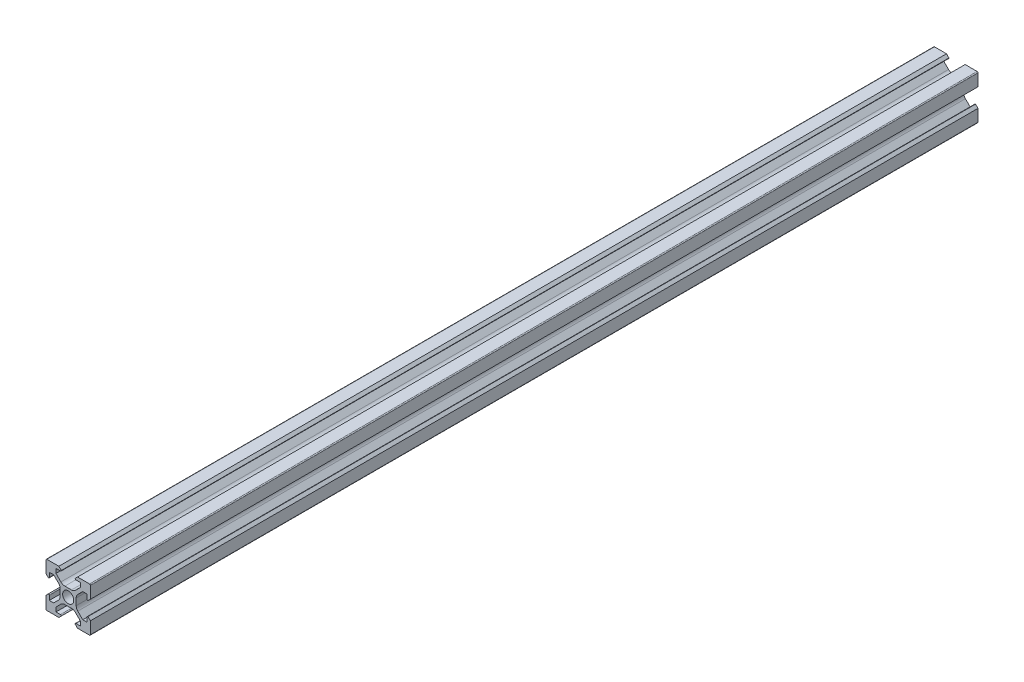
ISO-10303-21;
HEADER;
FILE_DESCRIPTION(('STEP AP214'),'2;1');
FILE_NAME('part.step','',(''),(''),'','','');
FILE_SCHEMA(('AUTOMOTIVE_DESIGN { 1 0 10303 214 1 1 1 1 }'));
ENDSEC;
DATA;
#1=APPLICATION_CONTEXT('core data for automotive mechanical design processes');
#2=APPLICATION_PROTOCOL_DEFINITION('international standard','automotive_design',2000,#1);
#3=PRODUCT_CONTEXT('',#1,'mechanical');
#4=PRODUCT('Part','Part','',(#3));
#5=PRODUCT_RELATED_PRODUCT_CATEGORY('part','',(#4));
#6=PRODUCT_DEFINITION_FORMATION('','',#4);
#7=PRODUCT_DEFINITION_CONTEXT('part definition',#1,'design');
#8=PRODUCT_DEFINITION('design','',#6,#7);
#9=PRODUCT_DEFINITION_SHAPE('','',#8);
#10=(LENGTH_UNIT() NAMED_UNIT(*) SI_UNIT(.MILLI.,.METRE.));
#11=(NAMED_UNIT(*) PLANE_ANGLE_UNIT() SI_UNIT($,.RADIAN.));
#12=(NAMED_UNIT(*) SI_UNIT($,.STERADIAN.) SOLID_ANGLE_UNIT());
#13=UNCERTAINTY_MEASURE_WITH_UNIT(LENGTH_MEASURE(1.E-05),#10,'distance_accuracy_value','');
#14=(GEOMETRIC_REPRESENTATION_CONTEXT(3) GLOBAL_UNCERTAINTY_ASSIGNED_CONTEXT((#13)) GLOBAL_UNIT_ASSIGNED_CONTEXT((#10,
#11,#12)) REPRESENTATION_CONTEXT('',''));
#15=CARTESIAN_POINT('',(0.,0.,0.));
#16=DIRECTION('',(0.,0.,1.));
#17=DIRECTION('',(1.,0.,0.));
#18=AXIS2_PLACEMENT_3D('',#15,#16,#17);
#19=CARTESIAN_POINT('',(-1.50380592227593,6.09999999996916,200.));
#20=DIRECTION('',(0.,0.,1.));
#21=DIRECTION('',(1.,0.,0.));
#22=AXIS2_PLACEMENT_3D('',#19,#20,#21);
#23=PLANE('',#22);
#24=DIRECTION('',(-0.707106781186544,0.707106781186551,0.));
#25=VECTOR('',#24,1.);
#26=CARTESIAN_POINT('',(-5.49999999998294,6.56066017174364,200.));
#27=LINE('',#26,#25);
#28=CARTESIAN_POINT('',(-3.27157287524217,4.33223304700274,200.));
#29=VERTEX_POINT('',#28);
#30=CARTESIAN_POINT('',(-5.49999999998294,6.56066017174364,200.));
#31=VERTEX_POINT('',#30);
#32=EDGE_CURVE('E674',#29,#31,#27,.T.);
#33=ORIENTED_EDGE('',*,*,#32,.T.);
#34=DIRECTION('',(0.,1.,0.));
#35=VECTOR('',#34,1.);
#36=CARTESIAN_POINT('',(-5.49999999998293,8.49999999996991,200.));
#37=LINE('',#36,#35);
#38=CARTESIAN_POINT('',(-5.49999999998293,8.49999999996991,200.));
#39=VERTEX_POINT('',#38);
#40=EDGE_CURVE('E272',#31,#39,#37,.T.);
#41=ORIENTED_EDGE('',*,*,#40,.T.);
#42=DIRECTION('',(1.,0.,0.));
#43=VECTOR('',#42,1.);
#44=CARTESIAN_POINT('',(-5.49999999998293,8.49999999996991,200.));
#45=LINE('',#44,#43);
#46=CARTESIAN_POINT('',(-3.49999999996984,8.4999999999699,200.));
#47=VERTEX_POINT('',#46);
#48=EDGE_CURVE('E919',#39,#47,#45,.T.);
#49=ORIENTED_EDGE('',*,*,#48,.T.);
#50=CARTESIAN_POINT('',(-3.49999999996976,8.8999999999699,200.));
#51=DIRECTION('',(0.,0.,1.));
#52=DIRECTION('',(1.,0.,0.));
#53=AXIS2_PLACEMENT_3D('',#50,#51,#52);
#54=CIRCLE('',#53,0.4);
#55=CARTESIAN_POINT('',(-3.09999999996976,8.8999999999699,200.));
#56=VERTEX_POINT('',#55);
#57=EDGE_CURVE('E939',#47,#56,#54,.T.);
#58=ORIENTED_EDGE('',*,*,#57,.T.);
#59=DIRECTION('',(-0.707106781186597,0.707106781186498,0.));
#60=VECTOR('',#59,1.);
#61=CARTESIAN_POINT('',(-3.09999999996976,8.89999999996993,200.));
#62=LINE('',#61,#60);
#63=CARTESIAN_POINT('',(-4.19999999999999,10.,200.));
#64=VERTEX_POINT('',#63);
#65=EDGE_CURVE('E935',#56,#64,#62,.T.);
#66=ORIENTED_EDGE('',*,*,#65,.T.);
#67=DIRECTION('',(-1.,0.,0.));
#68=VECTOR('',#67,1.);
#69=CARTESIAN_POINT('',(-9.59999999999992,10.0000000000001,200.));
#70=LINE('',#69,#68);
#71=CARTESIAN_POINT('',(-9.59999999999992,10.0000000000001,200.));
#72=VERTEX_POINT('',#71);
#73=EDGE_CURVE('E938',#64,#72,#70,.T.);
#74=ORIENTED_EDGE('',*,*,#73,.T.);
#75=CARTESIAN_POINT('',(-9.59999999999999,9.60000000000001,200.));
#76=DIRECTION('',(0.,0.,1.));
#77=DIRECTION('',(1.,0.,0.));
#78=AXIS2_PLACEMENT_3D('',#75,#76,#77);
#79=CIRCLE('',#78,0.400000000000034);
#80=CARTESIAN_POINT('',(-10.,9.60000000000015,200.));
#81=VERTEX_POINT('',#80);
#82=EDGE_CURVE('E943',#72,#81,#79,.T.);
#83=ORIENTED_EDGE('',*,*,#82,.T.);
#84=DIRECTION('',(0.,-1.,0.));
#85=VECTOR('',#84,1.);
#86=CARTESIAN_POINT('',(-9.99999999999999,9.60000000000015,200.));
#87=LINE('',#86,#85);
#88=CARTESIAN_POINT('',(-9.99999999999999,4.2,200.));
#89=VERTEX_POINT('',#88);
#90=EDGE_CURVE('E950',#81,#89,#87,.T.);
#91=ORIENTED_EDGE('',*,*,#90,.T.);
#92=DIRECTION('',(0.707106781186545,-0.70710678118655,0.));
#93=VECTOR('',#92,1.);
#94=CARTESIAN_POINT('',(-8.89999999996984,3.09999999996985,200.));
#95=LINE('',#94,#93);
#96=CARTESIAN_POINT('',(-8.89999999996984,3.09999999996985,200.));
#97=VERTEX_POINT('',#96);
#98=EDGE_CURVE('E953',#89,#97,#95,.T.);
#99=ORIENTED_EDGE('',*,*,#98,.T.);
#100=CARTESIAN_POINT('',(-8.89999999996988,3.49999999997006,200.));
#101=DIRECTION('',(0.,0.,1.));
#102=DIRECTION('',(-1.,0.,0.));
#103=AXIS2_PLACEMENT_3D('',#100,#101,#102);
#104=CIRCLE('',#103,0.400000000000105);
#105=CARTESIAN_POINT('',(-8.49999999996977,3.49999999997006,200.));
#106=VERTEX_POINT('',#105);
#107=EDGE_CURVE('E956',#97,#106,#104,.T.);
#108=ORIENTED_EDGE('',*,*,#107,.T.);
#109=DIRECTION('',(0.,1.,0.));
#110=VECTOR('',#109,1.);
#111=CARTESIAN_POINT('',(-8.49999999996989,5.49999999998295,200.));
#112=LINE('',#111,#110);
#113=CARTESIAN_POINT('',(-8.49999999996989,5.49999999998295,200.));
#114=VERTEX_POINT('',#113);
#115=EDGE_CURVE('E959',#106,#114,#112,.T.);
#116=ORIENTED_EDGE('',*,*,#115,.T.);
#117=DIRECTION('',(1.,0.,0.));
#118=VECTOR('',#117,1.);
#119=CARTESIAN_POINT('',(-8.49999999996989,5.49999999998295,200.));
#120=LINE('',#119,#118);
#121=CARTESIAN_POINT('',(-6.56066017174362,5.49999999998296,200.));
#122=VERTEX_POINT('',#121);
#123=EDGE_CURVE('E962',#114,#122,#120,.T.);
#124=ORIENTED_EDGE('',*,*,#123,.T.);
#125=DIRECTION('',(0.707106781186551,-0.707106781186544,0.));
#126=VECTOR('',#125,1.);
#127=CARTESIAN_POINT('',(-6.56066017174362,5.49999999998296,200.));
#128=LINE('',#127,#126);
#129=CARTESIAN_POINT('',(-4.33223304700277,3.27157287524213,200.));
#130=VERTEX_POINT('',#129);
#131=EDGE_CURVE('E965',#122,#130,#128,.T.);
#132=ORIENTED_EDGE('',*,*,#131,.T.);
#133=CARTESIAN_POINT('',(-6.09999999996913,1.50380592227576,200.));
#134=DIRECTION('',(0.,0.,-1.));
#135=DIRECTION('',(-1.,0.,0.));
#136=AXIS2_PLACEMENT_3D('',#133,#134,#135);
#137=CIRCLE('',#136,2.5);
#138=CARTESIAN_POINT('',(-3.59999999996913,1.50380592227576,200.));
#139=VERTEX_POINT('',#138);
#140=EDGE_CURVE('E968',#130,#139,#137,.T.);
#141=ORIENTED_EDGE('',*,*,#140,.T.);
#142=DIRECTION('',(0.,-1.,0.));
#143=VECTOR('',#142,1.);
#144=CARTESIAN_POINT('',(-3.59999999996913,1.50380592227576,200.));
#145=LINE('',#144,#143);
#146=CARTESIAN_POINT('',(-3.59999999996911,-1.50380592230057,200.));
#147=VERTEX_POINT('',#146);
#148=EDGE_CURVE('E971',#139,#147,#145,.T.);
#149=ORIENTED_EDGE('',*,*,#148,.T.);
#150=CARTESIAN_POINT('',(-6.09999999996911,-1.50380592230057,200.));
#151=DIRECTION('',(0.,0.,-1.));
#152=DIRECTION('',(1.,0.,0.));
#153=AXIS2_PLACEMENT_3D('',#150,#151,#152);
#154=CIRCLE('',#153,2.50000000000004);
#155=CARTESIAN_POINT('',(-4.33223304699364,-3.2715728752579,200.));
#156=VERTEX_POINT('',#155);
#157=EDGE_CURVE('E974',#147,#156,#154,.T.);
#158=ORIENTED_EDGE('',*,*,#157,.T.);
#159=DIRECTION('',(-0.707106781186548,-0.707106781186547,0.));
#160=VECTOR('',#159,1.);
#161=CARTESIAN_POINT('',(-6.56066017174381,-5.50000000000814,200.));
#162=LINE('',#161,#160);
#163=CARTESIAN_POINT('',(-6.56066017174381,-5.50000000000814,200.));
#164=VERTEX_POINT('',#163);
#165=EDGE_CURVE('E977',#156,#164,#162,.T.);
#166=ORIENTED_EDGE('',*,*,#165,.T.);
#167=DIRECTION('',(-1.,0.,0.));
#168=VECTOR('',#167,1.);
#169=CARTESIAN_POINT('',(-8.49999999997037,-5.50000000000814,200.));
#170=LINE('',#169,#168);
#171=CARTESIAN_POINT('',(-8.49999999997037,-5.50000000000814,200.));
#172=VERTEX_POINT('',#171);
#173=EDGE_CURVE('E980',#164,#172,#170,.T.);
#174=ORIENTED_EDGE('',*,*,#173,.T.);
#175=DIRECTION('',(0.,1.,0.));
#176=VECTOR('',#175,1.);
#177=CARTESIAN_POINT('',(-8.49999999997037,-5.50000000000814,200.));
#178=LINE('',#177,#176);
#179=CARTESIAN_POINT('',(-8.49999999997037,-3.49999999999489,200.));
#180=VERTEX_POINT('',#179);
#181=EDGE_CURVE('E983',#172,#180,#178,.T.);
#182=ORIENTED_EDGE('',*,*,#181,.T.);
#183=CARTESIAN_POINT('',(-8.89999999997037,-3.49999999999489,200.));
#184=DIRECTION('',(0.,0.,1.));
#185=DIRECTION('',(1.,0.,0.));
#186=AXIS2_PLACEMENT_3D('',#183,#184,#185);
#187=CIRCLE('',#186,0.400000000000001);
#188=CARTESIAN_POINT('',(-8.8999999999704,-3.09999999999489,200.));
#189=VERTEX_POINT('',#188);
#190=EDGE_CURVE('E986',#180,#189,#187,.T.);
#191=ORIENTED_EDGE('',*,*,#190,.T.);
#192=DIRECTION('',(-0.707106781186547,-0.707106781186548,0.));
#193=VECTOR('',#192,1.);
#194=CARTESIAN_POINT('',(-8.8999999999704,-3.09999999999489,200.));
#195=LINE('',#194,#193);
#196=CARTESIAN_POINT('',(-10.0000000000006,-4.20000000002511,200.));
#197=VERTEX_POINT('',#196);
#198=EDGE_CURVE('E989',#189,#197,#195,.T.);
#199=ORIENTED_EDGE('',*,*,#198,.T.);
#200=DIRECTION('',(0.,-1.,0.));
#201=VECTOR('',#200,1.);
#202=CARTESIAN_POINT('',(-10.0000000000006,-9.60000000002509,200.));
#203=LINE('',#202,#201);
#204=CARTESIAN_POINT('',(-10.0000000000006,-9.60000000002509,200.));
#205=VERTEX_POINT('',#204);
#206=EDGE_CURVE('E992',#197,#205,#203,.T.);
#207=ORIENTED_EDGE('',*,*,#206,.T.);
#208=CARTESIAN_POINT('',(-9.60000000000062,-9.60000000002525,200.));
#209=DIRECTION('',(0.,0.,1.));
#210=DIRECTION('',(1.,0.,0.));
#211=AXIS2_PLACEMENT_3D('',#208,#209,#210);
#212=CIRCLE('',#211,0.4);
#213=CARTESIAN_POINT('',(-9.60000000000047,-10.0000000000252,200.));
#214=VERTEX_POINT('',#213);
#215=EDGE_CURVE('E995',#205,#214,#212,.T.);
#216=ORIENTED_EDGE('',*,*,#215,.T.);
#217=DIRECTION('',(1.,0.,0.));
#218=VECTOR('',#217,1.);
#219=CARTESIAN_POINT('',(-9.60000000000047,-10.0000000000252,200.));
#220=LINE('',#219,#218);
#221=CARTESIAN_POINT('',(-4.20000000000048,-10.0000000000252,200.));
#222=VERTEX_POINT('',#221);
#223=EDGE_CURVE('E998',#214,#222,#220,.T.);
#224=ORIENTED_EDGE('',*,*,#223,.T.);
#225=DIRECTION('',(0.707106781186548,0.707106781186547,0.));
#226=VECTOR('',#225,1.);
#227=CARTESIAN_POINT('',(-3.09999999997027,-8.89999999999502,200.));
#228=LINE('',#227,#226);
#229=CARTESIAN_POINT('',(-3.09999999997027,-8.89999999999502,200.));
#230=VERTEX_POINT('',#229);
#231=EDGE_CURVE('E1001',#222,#230,#228,.T.);
#232=ORIENTED_EDGE('',*,*,#231,.T.);
#233=CARTESIAN_POINT('',(-3.49999999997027,-8.89999999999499,200.));
#234=DIRECTION('',(0.,0.,1.));
#235=DIRECTION('',(-1.,0.,0.));
#236=AXIS2_PLACEMENT_3D('',#233,#234,#235);
#237=CIRCLE('',#236,0.400000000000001);
#238=CARTESIAN_POINT('',(-3.49999999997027,-8.49999999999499,200.));
#239=VERTEX_POINT('',#238);
#240=EDGE_CURVE('E1004',#230,#239,#237,.T.);
#241=ORIENTED_EDGE('',*,*,#240,.T.);
#242=DIRECTION('',(-1.,0.,0.));
#243=VECTOR('',#242,1.);
#244=CARTESIAN_POINT('',(-5.49999999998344,-8.49999999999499,200.));
#245=LINE('',#244,#243);
#246=CARTESIAN_POINT('',(-5.49999999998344,-8.49999999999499,200.));
#247=VERTEX_POINT('',#246);
#248=EDGE_CURVE('E1007',#239,#247,#245,.T.);
#249=ORIENTED_EDGE('',*,*,#248,.T.);
#250=DIRECTION('',(0.,1.,0.));
#251=VECTOR('',#250,1.);
#252=CARTESIAN_POINT('',(-5.49999999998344,-8.49999999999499,200.));
#253=LINE('',#252,#251);
#254=CARTESIAN_POINT('',(-5.49999999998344,-6.56066017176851,200.));
#255=VERTEX_POINT('',#254);
#256=EDGE_CURVE('E1010',#247,#255,#253,.T.);
#257=ORIENTED_EDGE('',*,*,#256,.T.);
#258=DIRECTION('',(0.707106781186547,0.707106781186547,0.));
#259=VECTOR('',#258,1.);
#260=CARTESIAN_POINT('',(-5.49999999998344,-6.56066017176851,200.));
#261=LINE('',#260,#259);
#262=CARTESIAN_POINT('',(-3.27157287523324,-4.33223304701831,200.));
#263=VERTEX_POINT('',#262);
#264=EDGE_CURVE('E1013',#255,#263,#261,.T.);
#265=ORIENTED_EDGE('',*,*,#264,.T.);
#266=CARTESIAN_POINT('',(-1.50380592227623,-6.09999999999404,200.));
#267=DIRECTION('',(0.,0.,-1.));
#268=DIRECTION('',(-1.,0.,0.));
#269=AXIS2_PLACEMENT_3D('',#266,#267,#268);
#270=CIRCLE('',#269,2.5);
#271=CARTESIAN_POINT('',(-1.50380592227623,-3.59999999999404,200.));
#272=VERTEX_POINT('',#271);
#273=EDGE_CURVE('E1016',#263,#272,#270,.T.);
#274=ORIENTED_EDGE('',*,*,#273,.T.);
#275=DIRECTION('',(1.,0.,0.));
#276=VECTOR('',#275,1.);
#277=CARTESIAN_POINT('',(-1.50380592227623,-3.59999999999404,200.));
#278=LINE('',#277,#276);
#279=CARTESIAN_POINT('',(1.50380592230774,-3.59999999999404,200.));
#280=VERTEX_POINT('',#279);
#281=EDGE_CURVE('E1019',#272,#280,#278,.T.);
#282=ORIENTED_EDGE('',*,*,#281,.T.);
#283=CARTESIAN_POINT('',(1.50380592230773,-6.09999999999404,200.));
#284=DIRECTION('',(0.,0.,-1.));
#285=DIRECTION('',(1.,0.,0.));
#286=AXIS2_PLACEMENT_3D('',#283,#284,#285);
#287=CIRCLE('',#286,2.5);
#288=CARTESIAN_POINT('',(3.27157287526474,-4.33223304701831,200.));
#289=VERTEX_POINT('',#288);
#290=EDGE_CURVE('E1022',#280,#289,#287,.T.);
#291=ORIENTED_EDGE('',*,*,#290,.T.);
#292=DIRECTION('',(0.707106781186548,-0.707106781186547,0.));
#293=VECTOR('',#292,1.);
#294=CARTESIAN_POINT('',(5.50000000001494,-6.56066017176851,200.));
#295=LINE('',#294,#293);
#296=CARTESIAN_POINT('',(5.50000000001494,-6.56066017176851,200.));
#297=VERTEX_POINT('',#296);
#298=EDGE_CURVE('E1025',#289,#297,#295,.T.);
#299=ORIENTED_EDGE('',*,*,#298,.T.);
#300=DIRECTION('',(0.,-1.,0.));
#301=VECTOR('',#300,1.);
#302=CARTESIAN_POINT('',(5.50000000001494,-8.49999999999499,200.));
#303=LINE('',#302,#301);
#304=CARTESIAN_POINT('',(5.50000000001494,-8.49999999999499,200.));
#305=VERTEX_POINT('',#304);
#306=EDGE_CURVE('E1028',#297,#305,#303,.T.);
#307=ORIENTED_EDGE('',*,*,#306,.T.);
#308=DIRECTION('',(-1.,0.,0.));
#309=VECTOR('',#308,1.);
#310=CARTESIAN_POINT('',(5.50000000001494,-8.49999999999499,200.));
#311=LINE('',#310,#309);
#312=CARTESIAN_POINT('',(3.50000000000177,-8.49999999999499,200.));
#313=VERTEX_POINT('',#312);
#314=EDGE_CURVE('E1031',#305,#313,#311,.T.);
#315=ORIENTED_EDGE('',*,*,#314,.T.);
#316=CARTESIAN_POINT('',(3.50000000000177,-8.89999999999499,200.));
#317=DIRECTION('',(0.,0.,1.));
#318=DIRECTION('',(1.,0.,0.));
#319=AXIS2_PLACEMENT_3D('',#316,#317,#318);
#320=CIRCLE('',#319,0.400000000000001);
#321=CARTESIAN_POINT('',(3.10000000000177,-8.89999999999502,200.));
#322=VERTEX_POINT('',#321);
#323=EDGE_CURVE('E1034',#313,#322,#320,.T.);
#324=ORIENTED_EDGE('',*,*,#323,.T.);
#325=DIRECTION('',(0.707106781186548,-0.707106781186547,0.));
#326=VECTOR('',#325,1.);
#327=CARTESIAN_POINT('',(3.10000000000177,-8.89999999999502,200.));
#328=LINE('',#327,#326);
#329=CARTESIAN_POINT('',(4.20000000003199,-10.0000000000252,200.));
#330=VERTEX_POINT('',#329);
#331=EDGE_CURVE('E1037',#322,#330,#328,.T.);
#332=ORIENTED_EDGE('',*,*,#331,.T.);
#333=DIRECTION('',(1.,0.,0.));
#334=VECTOR('',#333,1.);
#335=CARTESIAN_POINT('',(9.60000000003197,-10.0000000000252,200.));
#336=LINE('',#335,#334);
#337=CARTESIAN_POINT('',(9.60000000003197,-10.0000000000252,200.));
#338=VERTEX_POINT('',#337);
#339=EDGE_CURVE('E1040',#330,#338,#336,.T.);
#340=ORIENTED_EDGE('',*,*,#339,.T.);
#341=CARTESIAN_POINT('',(9.60000000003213,-9.60000000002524,200.));
#342=DIRECTION('',(0.,0.,1.));
#343=DIRECTION('',(-1.,0.,0.));
#344=AXIS2_PLACEMENT_3D('',#341,#342,#343);
#345=CIRCLE('',#344,0.4);
#346=CARTESIAN_POINT('',(10.0000000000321,-9.60000000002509,200.));
#347=VERTEX_POINT('',#346);
#348=EDGE_CURVE('E1043',#338,#347,#345,.T.);
#349=ORIENTED_EDGE('',*,*,#348,.T.);
#350=DIRECTION('',(0.,1.,0.));
#351=VECTOR('',#350,1.);
#352=CARTESIAN_POINT('',(10.0000000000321,-9.60000000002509,200.));
#353=LINE('',#352,#351);
#354=CARTESIAN_POINT('',(10.0000000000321,-4.20000000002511,200.));
#355=VERTEX_POINT('',#354);
#356=EDGE_CURVE('E1046',#347,#355,#353,.T.);
#357=ORIENTED_EDGE('',*,*,#356,.T.);
#358=DIRECTION('',(-0.707106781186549,0.707106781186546,0.));
#359=VECTOR('',#358,1.);
#360=CARTESIAN_POINT('',(8.9000000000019,-3.09999999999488,200.));
#361=LINE('',#360,#359);
#362=CARTESIAN_POINT('',(8.9000000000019,-3.09999999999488,200.));
#363=VERTEX_POINT('',#362);
#364=EDGE_CURVE('E1049',#355,#363,#361,.T.);
#365=ORIENTED_EDGE('',*,*,#364,.T.);
#366=CARTESIAN_POINT('',(8.90000000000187,-3.49999999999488,200.));
#367=DIRECTION('',(0.,0.,1.));
#368=DIRECTION('',(-1.,0.,0.));
#369=AXIS2_PLACEMENT_3D('',#366,#367,#368);
#370=CIRCLE('',#369,0.400000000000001);
#371=CARTESIAN_POINT('',(8.50000000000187,-3.49999999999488,200.));
#372=VERTEX_POINT('',#371);
#373=EDGE_CURVE('E1052',#363,#372,#370,.T.);
#374=ORIENTED_EDGE('',*,*,#373,.T.);
#375=DIRECTION('',(0.,-1.,0.));
#376=VECTOR('',#375,1.);
#377=CARTESIAN_POINT('',(8.50000000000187,-5.50000000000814,200.));
#378=LINE('',#377,#376);
#379=CARTESIAN_POINT('',(8.50000000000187,-5.50000000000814,200.));
#380=VERTEX_POINT('',#379);
#381=EDGE_CURVE('E1055',#372,#380,#378,.T.);
#382=ORIENTED_EDGE('',*,*,#381,.T.);
#383=DIRECTION('',(-1.,0.,0.));
#384=VECTOR('',#383,1.);
#385=CARTESIAN_POINT('',(8.50000000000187,-5.50000000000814,200.));
#386=LINE('',#385,#384);
#387=CARTESIAN_POINT('',(6.56066017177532,-5.50000000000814,200.));
#388=VERTEX_POINT('',#387);
#389=EDGE_CURVE('E1058',#380,#388,#386,.T.);
#390=ORIENTED_EDGE('',*,*,#389,.T.);
#391=DIRECTION('',(-0.707106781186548,0.707106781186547,0.));
#392=VECTOR('',#391,1.);
#393=CARTESIAN_POINT('',(6.56066017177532,-5.50000000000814,200.));
#394=LINE('',#393,#392);
#395=CARTESIAN_POINT('',(4.33223304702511,-3.27157287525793,200.));
#396=VERTEX_POINT('',#395);
#397=EDGE_CURVE('E1061',#388,#396,#394,.T.);
#398=ORIENTED_EDGE('',*,*,#397,.T.);
#399=CARTESIAN_POINT('',(6.10000000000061,-1.50380592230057,200.));
#400=DIRECTION('',(0.,0.,-1.));
#401=DIRECTION('',(-1.,0.,0.));
#402=AXIS2_PLACEMENT_3D('',#399,#400,#401);
#403=CIRCLE('',#402,2.50000000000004);
#404=CARTESIAN_POINT('',(3.60000000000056,-1.50380592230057,200.));
#405=VERTEX_POINT('',#404);
#406=EDGE_CURVE('E1064',#396,#405,#403,.T.);
#407=ORIENTED_EDGE('',*,*,#406,.T.);
#408=DIRECTION('',(0.,1.,0.));
#409=VECTOR('',#408,1.);
#410=CARTESIAN_POINT('',(3.60000000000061,-1.50380592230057,200.));
#411=LINE('',#410,#409);
#412=CARTESIAN_POINT('',(3.60000000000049,1.50380592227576,200.));
#413=VERTEX_POINT('',#412);
#414=EDGE_CURVE('E1067',#405,#413,#411,.T.);
#415=ORIENTED_EDGE('',*,*,#414,.T.);
#416=CARTESIAN_POINT('',(6.10000000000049,1.50380592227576,200.));
#417=DIRECTION('',(0.,0.,-1.));
#418=DIRECTION('',(1.,0.,0.));
#419=AXIS2_PLACEMENT_3D('',#416,#417,#418);
#420=CIRCLE('',#419,2.5);
#421=CARTESIAN_POINT('',(4.33223304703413,3.27157287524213,200.));
#422=VERTEX_POINT('',#421);
#423=EDGE_CURVE('E1070',#413,#422,#420,.T.);
#424=ORIENTED_EDGE('',*,*,#423,.T.);
#425=DIRECTION('',(0.70710678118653,0.707106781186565,0.));
#426=VECTOR('',#425,1.);
#427=CARTESIAN_POINT('',(6.56066017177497,5.49999999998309,200.));
#428=LINE('',#427,#426);
#429=CARTESIAN_POINT('',(6.56066017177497,5.49999999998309,200.));
#430=VERTEX_POINT('',#429);
#431=EDGE_CURVE('E1073',#422,#430,#428,.T.);
#432=ORIENTED_EDGE('',*,*,#431,.T.);
#433=DIRECTION('',(1.,0.,0.));
#434=VECTOR('',#433,1.);
#435=CARTESIAN_POINT('',(8.50000000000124,5.49999999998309,200.));
#436=LINE('',#435,#434);
#437=CARTESIAN_POINT('',(8.50000000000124,5.49999999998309,200.));
#438=VERTEX_POINT('',#437);
#439=EDGE_CURVE('E1076',#430,#438,#436,.T.);
#440=ORIENTED_EDGE('',*,*,#439,.T.);
#441=DIRECTION('',(0.,-1.,0.));
#442=VECTOR('',#441,1.);
#443=CARTESIAN_POINT('',(8.50000000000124,5.49999999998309,200.));
#444=LINE('',#443,#442);
#445=CARTESIAN_POINT('',(8.50000000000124,3.49999999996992,200.));
#446=VERTEX_POINT('',#445);
#447=EDGE_CURVE('E1079',#438,#446,#444,.T.);
#448=ORIENTED_EDGE('',*,*,#447,.T.);
#449=CARTESIAN_POINT('',(8.90000000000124,3.49999999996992,200.));
#450=DIRECTION('',(0.,0.,1.));
#451=DIRECTION('',(1.,0.,0.));
#452=AXIS2_PLACEMENT_3D('',#449,#450,#451);
#453=CIRCLE('',#452,0.399999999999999);
#454=CARTESIAN_POINT('',(8.90000000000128,3.09999999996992,200.));
#455=VERTEX_POINT('',#454);
#456=EDGE_CURVE('E1082',#446,#455,#453,.T.);
#457=ORIENTED_EDGE('',*,*,#456,.T.);
#458=DIRECTION('',(0.707106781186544,0.707106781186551,0.));
#459=VECTOR('',#458,1.);
#460=CARTESIAN_POINT('',(8.90000000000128,3.09999999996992,200.));
#461=LINE('',#460,#459);
#462=CARTESIAN_POINT('',(10.0000000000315,4.20000000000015,200.));
#463=VERTEX_POINT('',#462);
#464=EDGE_CURVE('E1085',#455,#463,#461,.T.);
#465=ORIENTED_EDGE('',*,*,#464,.T.);
#466=DIRECTION('',(0.,1.,0.));
#467=VECTOR('',#466,1.);
#468=CARTESIAN_POINT('',(10.0000000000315,9.60000000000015,200.));
#469=LINE('',#468,#467);
#470=CARTESIAN_POINT('',(10.0000000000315,9.60000000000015,200.));
#471=VERTEX_POINT('',#470);
#472=EDGE_CURVE('E1088',#463,#471,#469,.T.);
#473=ORIENTED_EDGE('',*,*,#472,.T.);
#474=CARTESIAN_POINT('',(9.60000000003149,9.60000000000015,200.));
#475=DIRECTION('',(0.,0.,1.));
#476=DIRECTION('',(-1.,0.,0.));
#477=AXIS2_PLACEMENT_3D('',#474,#475,#476);
#478=CIRCLE('',#477,0.400000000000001);
#479=CARTESIAN_POINT('',(9.60000000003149,10.0000000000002,200.));
#480=VERTEX_POINT('',#479);
#481=EDGE_CURVE('E1091',#471,#480,#478,.T.);
#482=ORIENTED_EDGE('',*,*,#481,.T.);
#483=DIRECTION('',(-1.,0.,0.));
#484=VECTOR('',#483,1.);
#485=CARTESIAN_POINT('',(9.60000000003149,10.0000000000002,200.));
#486=LINE('',#485,#484);
#487=CARTESIAN_POINT('',(4.20000000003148,10.0000000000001,200.));
#488=VERTEX_POINT('',#487);
#489=EDGE_CURVE('E1094',#480,#488,#486,.T.);
#490=ORIENTED_EDGE('',*,*,#489,.T.);
#491=DIRECTION('',(-0.707106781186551,-0.707106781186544,0.));
#492=VECTOR('',#491,1.);
#493=CARTESIAN_POINT('',(3.10000000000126,8.89999999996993,200.));
#494=LINE('',#493,#492);
#495=CARTESIAN_POINT('',(3.10000000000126,8.89999999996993,200.));
#496=VERTEX_POINT('',#495);
#497=EDGE_CURVE('E1097',#488,#496,#494,.T.);
#498=ORIENTED_EDGE('',*,*,#497,.T.);
#499=CARTESIAN_POINT('',(3.50000000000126,8.89999999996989,200.));
#500=DIRECTION('',(0.,0.,1.));
#501=DIRECTION('',(-1.,0.,0.));
#502=AXIS2_PLACEMENT_3D('',#499,#500,#501);
#503=CIRCLE('',#502,0.4);
#504=CARTESIAN_POINT('',(3.50000000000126,8.4999999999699,200.));
#505=VERTEX_POINT('',#504);
#506=EDGE_CURVE('E1100',#496,#505,#503,.T.);
#507=ORIENTED_EDGE('',*,*,#506,.T.);
#508=DIRECTION('',(1.,0.,0.));
#509=VECTOR('',#508,1.);
#510=CARTESIAN_POINT('',(5.50000000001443,8.4999999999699,200.));
#511=LINE('',#510,#509);
#512=CARTESIAN_POINT('',(5.50000000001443,8.4999999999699,200.));
#513=VERTEX_POINT('',#512);
#514=EDGE_CURVE('E1103',#505,#513,#511,.T.);
#515=ORIENTED_EDGE('',*,*,#514,.T.);
#516=DIRECTION('',(0.,-1.,0.));
#517=VECTOR('',#516,1.);
#518=CARTESIAN_POINT('',(5.50000000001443,8.4999999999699,200.));
#519=LINE('',#518,#517);
#520=CARTESIAN_POINT('',(5.50000000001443,6.56066017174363,200.));
#521=VERTEX_POINT('',#520);
#522=EDGE_CURVE('E1106',#513,#521,#519,.T.);
#523=ORIENTED_EDGE('',*,*,#522,.T.);
#524=DIRECTION('',(-0.707106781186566,-0.707106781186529,0.));
#525=VECTOR('',#524,1.);
#526=CARTESIAN_POINT('',(5.50000000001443,6.56066017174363,200.));
#527=LINE('',#526,#525);
#528=CARTESIAN_POINT('',(3.27157287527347,4.33223304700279,200.));
#529=VERTEX_POINT('',#528);
#530=EDGE_CURVE('E459',#521,#529,#527,.T.);
#531=ORIENTED_EDGE('',*,*,#530,.T.);
#532=CARTESIAN_POINT('',(1.5038059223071,6.09999999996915,200.));
#533=DIRECTION('',(0.,0.,-1.));
#534=DIRECTION('',(-1.,0.,0.));
#535=AXIS2_PLACEMENT_3D('',#532,#533,#534);
#536=CIRCLE('',#535,2.5);
#537=CARTESIAN_POINT('',(1.5038059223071,3.59999999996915,200.));
#538=VERTEX_POINT('',#537);
#539=EDGE_CURVE('E453',#529,#538,#536,.T.);
#540=ORIENTED_EDGE('',*,*,#539,.T.);
#541=DIRECTION('',(-1.,0.,0.));
#542=VECTOR('',#541,1.);
#543=CARTESIAN_POINT('',(-1.50380592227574,3.59999999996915,200.));
#544=LINE('',#543,#542);
#545=CARTESIAN_POINT('',(-1.50380592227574,3.59999999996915,200.));
#546=VERTEX_POINT('',#545);
#547=EDGE_CURVE('E457',#538,#546,#544,.T.);
#548=ORIENTED_EDGE('',*,*,#547,.T.);
#549=CARTESIAN_POINT('',(-1.50380592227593,6.09999999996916,200.));
#550=DIRECTION('',(0.,0.,-1.));
#551=DIRECTION('',(1.,0.,0.));
#552=AXIS2_PLACEMENT_3D('',#549,#550,#551);
#553=CIRCLE('',#552,2.49999999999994);
#554=EDGE_CURVE('E61',#546,#29,#553,.T.);
#555=ORIENTED_EDGE('',*,*,#554,.T.);
#556=EDGE_LOOP('',(#33,#41,#49,#58,#66,#74,#83,#91,#99,#108,#116,#124,#132,#141,#149,#158,#166,
#174,#182,#191,#199,#207,#216,#224,#232,#241,#249,#257,#265,#274,#282,#291,#299,#307,#315,#324,
#332,#340,#349,#357,#365,#374,#382,#390,#398,#407,#415,#424,#432,#440,#448,#457,#465,#473,#482,
#490,#498,#507,#515,#523,#531,#540,#548,#555));
#557=FACE_BOUND('',#556,.T.);
#558=CARTESIAN_POINT('',(1.57495544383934E-11,-1.55890925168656E-11,200.));
#559=DIRECTION('',(0.,0.,1.));
#560=DIRECTION('',(1.,0.,0.));
#561=AXIS2_PLACEMENT_3D('',#558,#559,#560);
#562=CIRCLE('',#561,2.50000000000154);
#563=CARTESIAN_POINT('',(2.50000000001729,-1.55890925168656E-11,200.));
#564=VERTEX_POINT('',#563);
#565=EDGE_CURVE('E486',#564,#564,#562,.T.);
#566=ORIENTED_EDGE('',*,*,#565,.F.);
#567=EDGE_LOOP('',(#566));
#568=FACE_BOUND('',#567,.T.);
#569=ADVANCED_FACE('F43',(#557,#568),#23,.T.);
#570=CARTESIAN_POINT('',(-1.50380592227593,6.09999999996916,-200.));
#571=DIRECTION('',(0.,0.,1.));
#572=DIRECTION('',(1.,0.,0.));
#573=AXIS2_PLACEMENT_3D('',#570,#571,#572);
#574=PLANE('',#573);
#575=DIRECTION('',(-0.707106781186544,0.707106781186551,0.));
#576=VECTOR('',#575,1.);
#577=CARTESIAN_POINT('',(-5.49999999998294,6.56066017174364,-200.));
#578=LINE('',#577,#576);
#579=CARTESIAN_POINT('',(-3.27157287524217,4.33223304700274,-200.));
#580=VERTEX_POINT('',#579);
#581=CARTESIAN_POINT('',(-5.49999999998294,6.56066017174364,-200.));
#582=VERTEX_POINT('',#581);
#583=EDGE_CURVE('E481',#580,#582,#578,.T.);
#584=ORIENTED_EDGE('',*,*,#583,.F.);
#585=CARTESIAN_POINT('',(-1.50380592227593,6.09999999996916,-200.));
#586=DIRECTION('',(0.,0.,-1.));
#587=DIRECTION('',(1.,0.,0.));
#588=AXIS2_PLACEMENT_3D('',#585,#586,#587);
#589=CIRCLE('',#588,2.49999999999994);
#590=CARTESIAN_POINT('',(-1.50380592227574,3.59999999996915,-200.));
#591=VERTEX_POINT('',#590);
#592=EDGE_CURVE('E264',#591,#580,#589,.T.);
#593=ORIENTED_EDGE('',*,*,#592,.F.);
#594=DIRECTION('',(-1.,0.,0.));
#595=VECTOR('',#594,1.);
#596=CARTESIAN_POINT('',(-1.50380592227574,3.59999999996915,-200.));
#597=LINE('',#596,#595);
#598=CARTESIAN_POINT('',(1.5038059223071,3.59999999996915,-200.));
#599=VERTEX_POINT('',#598);
#600=EDGE_CURVE('E258',#599,#591,#597,.T.);
#601=ORIENTED_EDGE('',*,*,#600,.F.);
#602=CARTESIAN_POINT('',(1.5038059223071,6.09999999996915,-200.));
#603=DIRECTION('',(0.,0.,-1.));
#604=DIRECTION('',(-1.,0.,0.));
#605=AXIS2_PLACEMENT_3D('',#602,#603,#604);
#606=CIRCLE('',#605,2.5);
#607=CARTESIAN_POINT('',(3.27157287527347,4.33223304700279,-200.));
#608=VERTEX_POINT('',#607);
#609=EDGE_CURVE('E468',#608,#599,#606,.T.);
#610=ORIENTED_EDGE('',*,*,#609,.F.);
#611=DIRECTION('',(-0.707106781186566,-0.707106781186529,0.));
#612=VECTOR('',#611,1.);
#613=CARTESIAN_POINT('',(5.50000000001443,6.56066017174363,-200.));
#614=LINE('',#613,#612);
#615=CARTESIAN_POINT('',(5.50000000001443,6.56066017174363,-200.));
#616=VERTEX_POINT('',#615);
#617=EDGE_CURVE('E665',#616,#608,#614,.T.);
#618=ORIENTED_EDGE('',*,*,#617,.F.);
#619=DIRECTION('',(0.,-1.,0.));
#620=VECTOR('',#619,1.);
#621=CARTESIAN_POINT('',(5.50000000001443,8.4999999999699,-200.));
#622=LINE('',#621,#620);
#623=CARTESIAN_POINT('',(5.50000000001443,8.4999999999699,-200.));
#624=VERTEX_POINT('',#623);
#625=EDGE_CURVE('E662',#624,#616,#622,.T.);
#626=ORIENTED_EDGE('',*,*,#625,.F.);
#627=DIRECTION('',(1.,0.,0.));
#628=VECTOR('',#627,1.);
#629=CARTESIAN_POINT('',(5.50000000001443,8.4999999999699,-200.));
#630=LINE('',#629,#628);
#631=CARTESIAN_POINT('',(3.50000000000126,8.4999999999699,-200.));
#632=VERTEX_POINT('',#631);
#633=EDGE_CURVE('E659',#632,#624,#630,.T.);
#634=ORIENTED_EDGE('',*,*,#633,.F.);
#635=CARTESIAN_POINT('',(3.50000000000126,8.89999999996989,-200.));
#636=DIRECTION('',(0.,0.,1.));
#637=DIRECTION('',(-1.,0.,0.));
#638=AXIS2_PLACEMENT_3D('',#635,#636,#637);
#639=CIRCLE('',#638,0.4);
#640=CARTESIAN_POINT('',(3.10000000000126,8.89999999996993,-200.));
#641=VERTEX_POINT('',#640);
#642=EDGE_CURVE('E656',#641,#632,#639,.T.);
#643=ORIENTED_EDGE('',*,*,#642,.F.);
#644=DIRECTION('',(-0.707106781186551,-0.707106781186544,0.));
#645=VECTOR('',#644,1.);
#646=CARTESIAN_POINT('',(3.10000000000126,8.89999999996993,-200.));
#647=LINE('',#646,#645);
#648=CARTESIAN_POINT('',(4.20000000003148,10.0000000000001,-200.));
#649=VERTEX_POINT('',#648);
#650=EDGE_CURVE('E653',#649,#641,#647,.T.);
#651=ORIENTED_EDGE('',*,*,#650,.F.);
#652=DIRECTION('',(-1.,0.,0.));
#653=VECTOR('',#652,1.);
#654=CARTESIAN_POINT('',(9.60000000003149,10.0000000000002,-200.));
#655=LINE('',#654,#653);
#656=CARTESIAN_POINT('',(9.60000000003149,10.0000000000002,-200.));
#657=VERTEX_POINT('',#656);
#658=EDGE_CURVE('E650',#657,#649,#655,.T.);
#659=ORIENTED_EDGE('',*,*,#658,.F.);
#660=CARTESIAN_POINT('',(9.60000000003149,9.60000000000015,-200.));
#661=DIRECTION('',(0.,0.,1.));
#662=DIRECTION('',(-1.,0.,0.));
#663=AXIS2_PLACEMENT_3D('',#660,#661,#662);
#664=CIRCLE('',#663,0.400000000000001);
#665=CARTESIAN_POINT('',(10.0000000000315,9.60000000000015,-200.));
#666=VERTEX_POINT('',#665);
#667=EDGE_CURVE('E647',#666,#657,#664,.T.);
#668=ORIENTED_EDGE('',*,*,#667,.F.);
#669=DIRECTION('',(0.,1.,0.));
#670=VECTOR('',#669,1.);
#671=CARTESIAN_POINT('',(10.0000000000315,9.60000000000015,-200.));
#672=LINE('',#671,#670);
#673=CARTESIAN_POINT('',(10.0000000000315,4.20000000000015,-200.));
#674=VERTEX_POINT('',#673);
#675=EDGE_CURVE('E644',#674,#666,#672,.T.);
#676=ORIENTED_EDGE('',*,*,#675,.F.);
#677=DIRECTION('',(0.707106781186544,0.707106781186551,0.));
#678=VECTOR('',#677,1.);
#679=CARTESIAN_POINT('',(8.90000000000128,3.09999999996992,-200.));
#680=LINE('',#679,#678);
#681=CARTESIAN_POINT('',(8.90000000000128,3.09999999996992,-200.));
#682=VERTEX_POINT('',#681);
#683=EDGE_CURVE('E641',#682,#674,#680,.T.);
#684=ORIENTED_EDGE('',*,*,#683,.F.);
#685=CARTESIAN_POINT('',(8.90000000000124,3.49999999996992,-200.));
#686=DIRECTION('',(0.,0.,1.));
#687=DIRECTION('',(1.,0.,0.));
#688=AXIS2_PLACEMENT_3D('',#685,#686,#687);
#689=CIRCLE('',#688,0.399999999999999);
#690=CARTESIAN_POINT('',(8.50000000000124,3.49999999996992,-200.));
#691=VERTEX_POINT('',#690);
#692=EDGE_CURVE('E638',#691,#682,#689,.T.);
#693=ORIENTED_EDGE('',*,*,#692,.F.);
#694=DIRECTION('',(0.,-1.,0.));
#695=VECTOR('',#694,1.);
#696=CARTESIAN_POINT('',(8.50000000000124,5.49999999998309,-200.));
#697=LINE('',#696,#695);
#698=CARTESIAN_POINT('',(8.50000000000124,5.49999999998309,-200.));
#699=VERTEX_POINT('',#698);
#700=EDGE_CURVE('E635',#699,#691,#697,.T.);
#701=ORIENTED_EDGE('',*,*,#700,.F.);
#702=DIRECTION('',(1.,0.,0.));
#703=VECTOR('',#702,1.);
#704=CARTESIAN_POINT('',(8.50000000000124,5.49999999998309,-200.));
#705=LINE('',#704,#703);
#706=CARTESIAN_POINT('',(6.56066017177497,5.49999999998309,-200.));
#707=VERTEX_POINT('',#706);
#708=EDGE_CURVE('E632',#707,#699,#705,.T.);
#709=ORIENTED_EDGE('',*,*,#708,.F.);
#710=DIRECTION('',(0.70710678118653,0.707106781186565,0.));
#711=VECTOR('',#710,1.);
#712=CARTESIAN_POINT('',(6.56066017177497,5.49999999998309,-200.));
#713=LINE('',#712,#711);
#714=CARTESIAN_POINT('',(4.33223304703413,3.27157287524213,-200.));
#715=VERTEX_POINT('',#714);
#716=EDGE_CURVE('E629',#715,#707,#713,.T.);
#717=ORIENTED_EDGE('',*,*,#716,.F.);
#718=CARTESIAN_POINT('',(6.10000000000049,1.50380592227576,-200.));
#719=DIRECTION('',(0.,0.,-1.));
#720=DIRECTION('',(1.,0.,0.));
#721=AXIS2_PLACEMENT_3D('',#718,#719,#720);
#722=CIRCLE('',#721,2.5);
#723=CARTESIAN_POINT('',(3.60000000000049,1.50380592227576,-200.));
#724=VERTEX_POINT('',#723);
#725=EDGE_CURVE('E626',#724,#715,#722,.T.);
#726=ORIENTED_EDGE('',*,*,#725,.F.);
#727=DIRECTION('',(0.,1.,0.));
#728=VECTOR('',#727,1.);
#729=CARTESIAN_POINT('',(3.60000000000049,1.50380592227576,-200.));
#730=LINE('',#729,#728);
#731=CARTESIAN_POINT('',(3.60000000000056,-1.50380592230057,-200.));
#732=VERTEX_POINT('',#731);
#733=EDGE_CURVE('E623',#732,#724,#730,.T.);
#734=ORIENTED_EDGE('',*,*,#733,.F.);
#735=CARTESIAN_POINT('',(6.10000000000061,-1.50380592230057,-200.));
#736=DIRECTION('',(0.,0.,-1.));
#737=DIRECTION('',(-1.,0.,0.));
#738=AXIS2_PLACEMENT_3D('',#735,#736,#737);
#739=CIRCLE('',#738,2.50000000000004);
#740=CARTESIAN_POINT('',(4.33223304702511,-3.27157287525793,-200.));
#741=VERTEX_POINT('',#740);
#742=EDGE_CURVE('E619',#741,#732,#739,.T.);
#743=ORIENTED_EDGE('',*,*,#742,.F.);
#744=DIRECTION('',(-0.707106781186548,0.707106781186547,0.));
#745=VECTOR('',#744,1.);
#746=CARTESIAN_POINT('',(6.56066017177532,-5.50000000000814,-200.));
#747=LINE('',#746,#745);
#748=CARTESIAN_POINT('',(6.56066017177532,-5.50000000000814,-200.));
#749=VERTEX_POINT('',#748);
#750=EDGE_CURVE('E616',#749,#741,#747,.T.);
#751=ORIENTED_EDGE('',*,*,#750,.F.);
#752=DIRECTION('',(-1.,0.,0.));
#753=VECTOR('',#752,1.);
#754=CARTESIAN_POINT('',(8.50000000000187,-5.50000000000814,-200.));
#755=LINE('',#754,#753);
#756=CARTESIAN_POINT('',(8.50000000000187,-5.50000000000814,-200.));
#757=VERTEX_POINT('',#756);
#758=EDGE_CURVE('E613',#757,#749,#755,.T.);
#759=ORIENTED_EDGE('',*,*,#758,.F.);
#760=DIRECTION('',(0.,-1.,0.));
#761=VECTOR('',#760,1.);
#762=CARTESIAN_POINT('',(8.50000000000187,-5.50000000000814,-200.));
#763=LINE('',#762,#761);
#764=CARTESIAN_POINT('',(8.50000000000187,-3.49999999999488,-200.));
#765=VERTEX_POINT('',#764);
#766=EDGE_CURVE('E610',#765,#757,#763,.T.);
#767=ORIENTED_EDGE('',*,*,#766,.F.);
#768=CARTESIAN_POINT('',(8.90000000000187,-3.49999999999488,-200.));
#769=DIRECTION('',(0.,0.,1.));
#770=DIRECTION('',(-1.,0.,0.));
#771=AXIS2_PLACEMENT_3D('',#768,#769,#770);
#772=CIRCLE('',#771,0.400000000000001);
#773=CARTESIAN_POINT('',(8.9000000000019,-3.09999999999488,-200.));
#774=VERTEX_POINT('',#773);
#775=EDGE_CURVE('E607',#774,#765,#772,.T.);
#776=ORIENTED_EDGE('',*,*,#775,.F.);
#777=DIRECTION('',(-0.707106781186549,0.707106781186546,0.));
#778=VECTOR('',#777,1.);
#779=CARTESIAN_POINT('',(8.9000000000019,-3.09999999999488,-200.));
#780=LINE('',#779,#778);
#781=CARTESIAN_POINT('',(10.0000000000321,-4.20000000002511,-200.));
#782=VERTEX_POINT('',#781);
#783=EDGE_CURVE('E604',#782,#774,#780,.T.);
#784=ORIENTED_EDGE('',*,*,#783,.F.);
#785=DIRECTION('',(0.,1.,0.));
#786=VECTOR('',#785,1.);
#787=CARTESIAN_POINT('',(10.0000000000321,-9.60000000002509,-200.));
#788=LINE('',#787,#786);
#789=CARTESIAN_POINT('',(10.0000000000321,-9.60000000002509,-200.));
#790=VERTEX_POINT('',#789);
#791=EDGE_CURVE('E601',#790,#782,#788,.T.);
#792=ORIENTED_EDGE('',*,*,#791,.F.);
#793=CARTESIAN_POINT('',(9.60000000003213,-9.60000000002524,-200.));
#794=DIRECTION('',(0.,0.,1.));
#795=DIRECTION('',(-1.,0.,0.));
#796=AXIS2_PLACEMENT_3D('',#793,#794,#795);
#797=CIRCLE('',#796,0.4);
#798=CARTESIAN_POINT('',(9.60000000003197,-10.0000000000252,-200.));
#799=VERTEX_POINT('',#798);
#800=EDGE_CURVE('E598',#799,#790,#797,.T.);
#801=ORIENTED_EDGE('',*,*,#800,.F.);
#802=DIRECTION('',(1.,0.,0.));
#803=VECTOR('',#802,1.);
#804=CARTESIAN_POINT('',(9.60000000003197,-10.0000000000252,-200.));
#805=LINE('',#804,#803);
#806=CARTESIAN_POINT('',(4.20000000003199,-10.0000000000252,-200.));
#807=VERTEX_POINT('',#806);
#808=EDGE_CURVE('E595',#807,#799,#805,.T.);
#809=ORIENTED_EDGE('',*,*,#808,.F.);
#810=DIRECTION('',(0.707106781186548,-0.707106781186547,0.));
#811=VECTOR('',#810,1.);
#812=CARTESIAN_POINT('',(3.10000000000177,-8.89999999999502,-200.));
#813=LINE('',#812,#811);
#814=CARTESIAN_POINT('',(3.10000000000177,-8.89999999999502,-200.));
#815=VERTEX_POINT('',#814);
#816=EDGE_CURVE('E592',#815,#807,#813,.T.);
#817=ORIENTED_EDGE('',*,*,#816,.F.);
#818=CARTESIAN_POINT('',(3.50000000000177,-8.89999999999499,-200.));
#819=DIRECTION('',(0.,0.,1.));
#820=DIRECTION('',(1.,0.,0.));
#821=AXIS2_PLACEMENT_3D('',#818,#819,#820);
#822=CIRCLE('',#821,0.400000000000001);
#823=CARTESIAN_POINT('',(3.50000000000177,-8.49999999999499,-200.));
#824=VERTEX_POINT('',#823);
#825=EDGE_CURVE('E589',#824,#815,#822,.T.);
#826=ORIENTED_EDGE('',*,*,#825,.F.);
#827=DIRECTION('',(-1.,0.,0.));
#828=VECTOR('',#827,1.);
#829=CARTESIAN_POINT('',(5.50000000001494,-8.49999999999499,-200.));
#830=LINE('',#829,#828);
#831=CARTESIAN_POINT('',(5.50000000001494,-8.49999999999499,-200.));
#832=VERTEX_POINT('',#831);
#833=EDGE_CURVE('E586',#832,#824,#830,.T.);
#834=ORIENTED_EDGE('',*,*,#833,.F.);
#835=DIRECTION('',(0.,-1.,0.));
#836=VECTOR('',#835,1.);
#837=CARTESIAN_POINT('',(5.50000000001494,-8.49999999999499,-200.));
#838=LINE('',#837,#836);
#839=CARTESIAN_POINT('',(5.50000000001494,-6.56066017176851,-200.));
#840=VERTEX_POINT('',#839);
#841=EDGE_CURVE('E583',#840,#832,#838,.T.);
#842=ORIENTED_EDGE('',*,*,#841,.F.);
#843=DIRECTION('',(0.707106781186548,-0.707106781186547,0.));
#844=VECTOR('',#843,1.);
#845=CARTESIAN_POINT('',(5.50000000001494,-6.56066017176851,-200.));
#846=LINE('',#845,#844);
#847=CARTESIAN_POINT('',(3.27157287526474,-4.33223304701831,-200.));
#848=VERTEX_POINT('',#847);
#849=EDGE_CURVE('E580',#848,#840,#846,.T.);
#850=ORIENTED_EDGE('',*,*,#849,.F.);
#851=CARTESIAN_POINT('',(1.50380592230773,-6.09999999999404,-200.));
#852=DIRECTION('',(0.,0.,-1.));
#853=DIRECTION('',(1.,0.,0.));
#854=AXIS2_PLACEMENT_3D('',#851,#852,#853);
#855=CIRCLE('',#854,2.5);
#856=CARTESIAN_POINT('',(1.50380592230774,-3.59999999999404,-200.));
#857=VERTEX_POINT('',#856);
#858=EDGE_CURVE('E577',#857,#848,#855,.T.);
#859=ORIENTED_EDGE('',*,*,#858,.F.);
#860=DIRECTION('',(1.,0.,0.));
#861=VECTOR('',#860,1.);
#862=CARTESIAN_POINT('',(-1.50380592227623,-3.59999999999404,-200.));
#863=LINE('',#862,#861);
#864=CARTESIAN_POINT('',(-1.50380592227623,-3.59999999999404,-200.));
#865=VERTEX_POINT('',#864);
#866=EDGE_CURVE('E574',#865,#857,#863,.T.);
#867=ORIENTED_EDGE('',*,*,#866,.F.);
#868=CARTESIAN_POINT('',(-1.50380592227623,-6.09999999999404,-200.));
#869=DIRECTION('',(0.,0.,-1.));
#870=DIRECTION('',(-1.,0.,0.));
#871=AXIS2_PLACEMENT_3D('',#868,#869,#870);
#872=CIRCLE('',#871,2.5);
#873=CARTESIAN_POINT('',(-3.27157287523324,-4.33223304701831,-200.));
#874=VERTEX_POINT('',#873);
#875=EDGE_CURVE('E571',#874,#865,#872,.T.);
#876=ORIENTED_EDGE('',*,*,#875,.F.);
#877=DIRECTION('',(0.707106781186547,0.707106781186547,0.));
#878=VECTOR('',#877,1.);
#879=CARTESIAN_POINT('',(-5.49999999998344,-6.56066017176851,-200.));
#880=LINE('',#879,#878);
#881=CARTESIAN_POINT('',(-5.49999999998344,-6.56066017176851,-200.));
#882=VERTEX_POINT('',#881);
#883=EDGE_CURVE('E568',#882,#874,#880,.T.);
#884=ORIENTED_EDGE('',*,*,#883,.F.);
#885=DIRECTION('',(0.,1.,0.));
#886=VECTOR('',#885,1.);
#887=CARTESIAN_POINT('',(-5.49999999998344,-8.49999999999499,-200.));
#888=LINE('',#887,#886);
#889=CARTESIAN_POINT('',(-5.49999999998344,-8.49999999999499,-200.));
#890=VERTEX_POINT('',#889);
#891=EDGE_CURVE('E565',#890,#882,#888,.T.);
#892=ORIENTED_EDGE('',*,*,#891,.F.);
#893=DIRECTION('',(-1.,0.,0.));
#894=VECTOR('',#893,1.);
#895=CARTESIAN_POINT('',(-5.49999999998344,-8.49999999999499,-200.));
#896=LINE('',#895,#894);
#897=CARTESIAN_POINT('',(-3.49999999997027,-8.49999999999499,-200.));
#898=VERTEX_POINT('',#897);
#899=EDGE_CURVE('E562',#898,#890,#896,.T.);
#900=ORIENTED_EDGE('',*,*,#899,.F.);
#901=CARTESIAN_POINT('',(-3.49999999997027,-8.89999999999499,-200.));
#902=DIRECTION('',(0.,0.,1.));
#903=DIRECTION('',(-1.,0.,0.));
#904=AXIS2_PLACEMENT_3D('',#901,#902,#903);
#905=CIRCLE('',#904,0.400000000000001);
#906=CARTESIAN_POINT('',(-3.09999999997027,-8.89999999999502,-200.));
#907=VERTEX_POINT('',#906);
#908=EDGE_CURVE('E559',#907,#898,#905,.T.);
#909=ORIENTED_EDGE('',*,*,#908,.F.);
#910=DIRECTION('',(0.707106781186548,0.707106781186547,0.));
#911=VECTOR('',#910,1.);
#912=CARTESIAN_POINT('',(-3.09999999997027,-8.89999999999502,-200.));
#913=LINE('',#912,#911);
#914=CARTESIAN_POINT('',(-4.20000000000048,-10.0000000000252,-200.));
#915=VERTEX_POINT('',#914);
#916=EDGE_CURVE('E556',#915,#907,#913,.T.);
#917=ORIENTED_EDGE('',*,*,#916,.F.);
#918=DIRECTION('',(1.,0.,0.));
#919=VECTOR('',#918,1.);
#920=CARTESIAN_POINT('',(-9.60000000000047,-10.0000000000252,-200.));
#921=LINE('',#920,#919);
#922=CARTESIAN_POINT('',(-9.60000000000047,-10.0000000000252,-200.));
#923=VERTEX_POINT('',#922);
#924=EDGE_CURVE('E553',#923,#915,#921,.T.);
#925=ORIENTED_EDGE('',*,*,#924,.F.);
#926=CARTESIAN_POINT('',(-9.60000000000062,-9.60000000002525,-200.));
#927=DIRECTION('',(0.,0.,1.));
#928=DIRECTION('',(1.,0.,0.));
#929=AXIS2_PLACEMENT_3D('',#926,#927,#928);
#930=CIRCLE('',#929,0.4);
#931=CARTESIAN_POINT('',(-10.0000000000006,-9.60000000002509,-200.));
#932=VERTEX_POINT('',#931);
#933=EDGE_CURVE('E550',#932,#923,#930,.T.);
#934=ORIENTED_EDGE('',*,*,#933,.F.);
#935=DIRECTION('',(0.,-1.,0.));
#936=VECTOR('',#935,1.);
#937=CARTESIAN_POINT('',(-10.0000000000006,-9.60000000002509,-200.));
#938=LINE('',#937,#936);
#939=CARTESIAN_POINT('',(-10.0000000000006,-4.20000000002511,-200.));
#940=VERTEX_POINT('',#939);
#941=EDGE_CURVE('E547',#940,#932,#938,.T.);
#942=ORIENTED_EDGE('',*,*,#941,.F.);
#943=DIRECTION('',(-0.707106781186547,-0.707106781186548,0.));
#944=VECTOR('',#943,1.);
#945=CARTESIAN_POINT('',(-8.8999999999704,-3.09999999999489,-200.));
#946=LINE('',#945,#944);
#947=CARTESIAN_POINT('',(-8.8999999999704,-3.09999999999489,-200.));
#948=VERTEX_POINT('',#947);
#949=EDGE_CURVE('E544',#948,#940,#946,.T.);
#950=ORIENTED_EDGE('',*,*,#949,.F.);
#951=CARTESIAN_POINT('',(-8.89999999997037,-3.49999999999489,-200.));
#952=DIRECTION('',(0.,0.,1.));
#953=DIRECTION('',(1.,0.,0.));
#954=AXIS2_PLACEMENT_3D('',#951,#952,#953);
#955=CIRCLE('',#954,0.400000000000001);
#956=CARTESIAN_POINT('',(-8.49999999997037,-3.49999999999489,-200.));
#957=VERTEX_POINT('',#956);
#958=EDGE_CURVE('E541',#957,#948,#955,.T.);
#959=ORIENTED_EDGE('',*,*,#958,.F.);
#960=DIRECTION('',(0.,1.,0.));
#961=VECTOR('',#960,1.);
#962=CARTESIAN_POINT('',(-8.49999999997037,-5.50000000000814,-200.));
#963=LINE('',#962,#961);
#964=CARTESIAN_POINT('',(-8.49999999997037,-5.50000000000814,-200.));
#965=VERTEX_POINT('',#964);
#966=EDGE_CURVE('E538',#965,#957,#963,.T.);
#967=ORIENTED_EDGE('',*,*,#966,.F.);
#968=DIRECTION('',(-1.,0.,0.));
#969=VECTOR('',#968,1.);
#970=CARTESIAN_POINT('',(-8.49999999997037,-5.50000000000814,-200.));
#971=LINE('',#970,#969);
#972=CARTESIAN_POINT('',(-6.56066017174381,-5.50000000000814,-200.));
#973=VERTEX_POINT('',#972);
#974=EDGE_CURVE('E535',#973,#965,#971,.T.);
#975=ORIENTED_EDGE('',*,*,#974,.F.);
#976=DIRECTION('',(-0.707106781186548,-0.707106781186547,0.));
#977=VECTOR('',#976,1.);
#978=CARTESIAN_POINT('',(-6.56066017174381,-5.50000000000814,-200.));
#979=LINE('',#978,#977);
#980=CARTESIAN_POINT('',(-4.33223304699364,-3.2715728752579,-200.));
#981=VERTEX_POINT('',#980);
#982=EDGE_CURVE('E532',#981,#973,#979,.T.);
#983=ORIENTED_EDGE('',*,*,#982,.F.);
#984=CARTESIAN_POINT('',(-6.09999999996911,-1.50380592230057,-200.));
#985=DIRECTION('',(0.,0.,-1.));
#986=DIRECTION('',(1.,0.,0.));
#987=AXIS2_PLACEMENT_3D('',#984,#985,#986);
#988=CIRCLE('',#987,2.50000000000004);
#989=CARTESIAN_POINT('',(-3.59999999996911,-1.50380592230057,-200.));
#990=VERTEX_POINT('',#989);
#991=EDGE_CURVE('E529',#990,#981,#988,.T.);
#992=ORIENTED_EDGE('',*,*,#991,.F.);
#993=DIRECTION('',(0.,-1.,0.));
#994=VECTOR('',#993,1.);
#995=CARTESIAN_POINT('',(-3.59999999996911,-1.50380592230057,-200.));
#996=LINE('',#995,#994);
#997=CARTESIAN_POINT('',(-3.59999999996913,1.50380592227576,-200.));
#998=VERTEX_POINT('',#997);
#999=EDGE_CURVE('E526',#998,#990,#996,.T.);
#1000=ORIENTED_EDGE('',*,*,#999,.F.);
#1001=CARTESIAN_POINT('',(-6.09999999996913,1.50380592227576,-200.));
#1002=DIRECTION('',(0.,0.,-1.));
#1003=DIRECTION('',(-1.,0.,0.));
#1004=AXIS2_PLACEMENT_3D('',#1001,#1002,#1003);
#1005=CIRCLE('',#1004,2.5);
#1006=CARTESIAN_POINT('',(-4.33223304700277,3.27157287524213,-200.));
#1007=VERTEX_POINT('',#1006);
#1008=EDGE_CURVE('E522',#1007,#998,#1005,.T.);
#1009=ORIENTED_EDGE('',*,*,#1008,.F.);
#1010=DIRECTION('',(0.707106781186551,-0.707106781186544,0.));
#1011=VECTOR('',#1010,1.);
#1012=CARTESIAN_POINT('',(-6.56066017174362,5.49999999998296,-200.));
#1013=LINE('',#1012,#1011);
#1014=CARTESIAN_POINT('',(-6.56066017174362,5.49999999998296,-200.));
#1015=VERTEX_POINT('',#1014);
#1016=EDGE_CURVE('E519',#1015,#1007,#1013,.T.);
#1017=ORIENTED_EDGE('',*,*,#1016,.F.);
#1018=DIRECTION('',(1.,0.,0.));
#1019=VECTOR('',#1018,1.);
#1020=CARTESIAN_POINT('',(-8.49999999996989,5.49999999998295,-200.));
#1021=LINE('',#1020,#1019);
#1022=CARTESIAN_POINT('',(-8.49999999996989,5.49999999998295,-200.));
#1023=VERTEX_POINT('',#1022);
#1024=EDGE_CURVE('E516',#1023,#1015,#1021,.T.);
#1025=ORIENTED_EDGE('',*,*,#1024,.F.);
#1026=DIRECTION('',(0.,1.,0.));
#1027=VECTOR('',#1026,1.);
#1028=CARTESIAN_POINT('',(-8.49999999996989,5.49999999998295,-200.));
#1029=LINE('',#1028,#1027);
#1030=CARTESIAN_POINT('',(-8.49999999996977,3.49999999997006,-200.));
#1031=VERTEX_POINT('',#1030);
#1032=EDGE_CURVE('E513',#1031,#1023,#1029,.T.);
#1033=ORIENTED_EDGE('',*,*,#1032,.F.);
#1034=CARTESIAN_POINT('',(-8.89999999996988,3.49999999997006,-200.));
#1035=DIRECTION('',(0.,0.,1.));
#1036=DIRECTION('',(-1.,0.,0.));
#1037=AXIS2_PLACEMENT_3D('',#1034,#1035,#1036);
#1038=CIRCLE('',#1037,0.400000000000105);
#1039=CARTESIAN_POINT('',(-8.89999999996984,3.09999999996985,-200.));
#1040=VERTEX_POINT('',#1039);
#1041=EDGE_CURVE('E510',#1040,#1031,#1038,.T.);
#1042=ORIENTED_EDGE('',*,*,#1041,.F.);
#1043=DIRECTION('',(0.707106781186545,-0.70710678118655,0.));
#1044=VECTOR('',#1043,1.);
#1045=CARTESIAN_POINT('',(-8.89999999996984,3.09999999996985,-200.));
#1046=LINE('',#1045,#1044);
#1047=CARTESIAN_POINT('',(-9.99999999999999,4.2,-200.));
#1048=VERTEX_POINT('',#1047);
#1049=EDGE_CURVE('E507',#1048,#1040,#1046,.T.);
#1050=ORIENTED_EDGE('',*,*,#1049,.F.);
#1051=DIRECTION('',(0.,-1.,0.));
#1052=VECTOR('',#1051,1.);
#1053=CARTESIAN_POINT('',(-9.99999999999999,9.60000000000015,-200.));
#1054=LINE('',#1053,#1052);
#1055=CARTESIAN_POINT('',(-10.,9.60000000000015,-200.));
#1056=VERTEX_POINT('',#1055);
#1057=EDGE_CURVE('E504',#1056,#1048,#1054,.T.);
#1058=ORIENTED_EDGE('',*,*,#1057,.F.);
#1059=CARTESIAN_POINT('',(-9.59999999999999,9.60000000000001,-200.));
#1060=DIRECTION('',(0.,0.,1.));
#1061=DIRECTION('',(1.,0.,0.));
#1062=AXIS2_PLACEMENT_3D('',#1059,#1060,#1061);
#1063=CIRCLE('',#1062,0.400000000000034);
#1064=CARTESIAN_POINT('',(-9.59999999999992,10.0000000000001,-200.));
#1065=VERTEX_POINT('',#1064);
#1066=EDGE_CURVE('E501',#1065,#1056,#1063,.T.);
#1067=ORIENTED_EDGE('',*,*,#1066,.F.);
#1068=DIRECTION('',(-1.,0.,0.));
#1069=VECTOR('',#1068,1.);
#1070=CARTESIAN_POINT('',(-9.59999999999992,10.0000000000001,-200.));
#1071=LINE('',#1070,#1069);
#1072=CARTESIAN_POINT('',(-4.19999999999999,10.,-200.));
#1073=VERTEX_POINT('',#1072);
#1074=EDGE_CURVE('E498',#1073,#1065,#1071,.T.);
#1075=ORIENTED_EDGE('',*,*,#1074,.F.);
#1076=DIRECTION('',(-0.707106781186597,0.707106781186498,0.));
#1077=VECTOR('',#1076,1.);
#1078=CARTESIAN_POINT('',(-3.09999999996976,8.89999999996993,-200.));
#1079=LINE('',#1078,#1077);
#1080=CARTESIAN_POINT('',(-3.09999999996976,8.8999999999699,-200.));
#1081=VERTEX_POINT('',#1080);
#1082=EDGE_CURVE('E495',#1081,#1073,#1079,.T.);
#1083=ORIENTED_EDGE('',*,*,#1082,.F.);
#1084=CARTESIAN_POINT('',(-3.49999999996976,8.8999999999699,-200.));
#1085=DIRECTION('',(0.,0.,1.));
#1086=DIRECTION('',(1.,0.,0.));
#1087=AXIS2_PLACEMENT_3D('',#1084,#1085,#1086);
#1088=CIRCLE('',#1087,0.4);
#1089=CARTESIAN_POINT('',(-3.49999999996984,8.4999999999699,-200.));
#1090=VERTEX_POINT('',#1089);
#1091=EDGE_CURVE('E492',#1090,#1081,#1088,.T.);
#1092=ORIENTED_EDGE('',*,*,#1091,.F.);
#1093=DIRECTION('',(1.,0.,0.));
#1094=VECTOR('',#1093,1.);
#1095=CARTESIAN_POINT('',(-5.49999999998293,8.49999999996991,-200.));
#1096=LINE('',#1095,#1094);
#1097=CARTESIAN_POINT('',(-5.49999999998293,8.49999999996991,-200.));
#1098=VERTEX_POINT('',#1097);
#1099=EDGE_CURVE('E489',#1098,#1090,#1096,.T.);
#1100=ORIENTED_EDGE('',*,*,#1099,.F.);
#1101=DIRECTION('',(0.,1.,0.));
#1102=VECTOR('',#1101,1.);
#1103=CARTESIAN_POINT('',(-5.49999999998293,8.49999999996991,-200.));
#1104=LINE('',#1103,#1102);
#1105=EDGE_CURVE('E485',#582,#1098,#1104,.T.);
#1106=ORIENTED_EDGE('',*,*,#1105,.F.);
#1107=EDGE_LOOP('',(#584,#593,#601,#610,#618,#626,#634,#643,#651,#659,#668,#676,#684,#693,#701,
#709,#717,#726,#734,#743,#751,#759,#767,#776,#784,#792,#801,#809,#817,#826,#834,#842,#850,#859,
#867,#876,#884,#892,#900,#909,#917,#925,#934,#942,#950,#959,#967,#975,#983,#992,#1000,#1009,
#1017,#1025,#1033,#1042,#1050,#1058,#1067,#1075,#1083,#1092,#1100,#1106));
#1108=FACE_BOUND('',#1107,.T.);
#1109=CARTESIAN_POINT('',(1.57495544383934E-11,-1.55890925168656E-11,-200.));
#1110=DIRECTION('',(0.,0.,1.));
#1111=DIRECTION('',(1.,0.,0.));
#1112=AXIS2_PLACEMENT_3D('',#1109,#1110,#1111);
#1113=CIRCLE('',#1112,2.50000000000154);
#1114=CARTESIAN_POINT('',(2.50000000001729,-1.55890925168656E-11,-200.));
#1115=VERTEX_POINT('',#1114);
#1116=EDGE_CURVE('E2070',#1115,#1115,#1113,.T.);
#1117=ORIENTED_EDGE('',*,*,#1116,.T.);
#1118=EDGE_LOOP('',(#1117));
#1119=FACE_BOUND('',#1118,.T.);
#1120=ADVANCED_FACE('F923',(#1108,#1119),#574,.F.);
#1121=CARTESIAN_POINT('',(-5.49999999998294,6.56066017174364,200.));
#1122=DIRECTION('',(-0.707106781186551,-0.707106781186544,0.));
#1123=DIRECTION('',(0.707106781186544,-0.707106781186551,0.));
#1124=AXIS2_PLACEMENT_3D('',#1121,#1122,#1123);
#1125=PLANE('',#1124);
#1126=ORIENTED_EDGE('',*,*,#583,.T.);
#1127=DIRECTION('',(0.,0.,-1.));
#1128=VECTOR('',#1127,1.);
#1129=CARTESIAN_POINT('',(-5.49999999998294,6.56066017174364,200.));
#1130=LINE('',#1129,#1128);
#1131=EDGE_CURVE('E11',#31,#582,#1130,.T.);
#1132=ORIENTED_EDGE('',*,*,#1131,.F.);
#1133=ORIENTED_EDGE('',*,*,#32,.F.);
#1134=DIRECTION('',(0.,0.,-1.));
#1135=VECTOR('',#1134,1.);
#1136=CARTESIAN_POINT('',(-3.27157287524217,4.33223304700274,200.));
#1137=LINE('',#1136,#1135);
#1138=EDGE_CURVE('E477',#29,#580,#1137,.T.);
#1139=ORIENTED_EDGE('',*,*,#1138,.T.);
#1140=EDGE_LOOP('',(#1126,#1132,#1133,#1139));
#1141=FACE_BOUND('',#1140,.T.);
#1142=ADVANCED_FACE('F45',(#1141),#1125,.F.);
#1143=CARTESIAN_POINT('',(-5.49999999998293,8.49999999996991,200.));
#1144=DIRECTION('',(-1.,0.,0.));
#1145=DIRECTION('',(0.,-1.,0.));
#1146=AXIS2_PLACEMENT_3D('',#1143,#1144,#1145);
#1147=PLANE('',#1146);
#1148=ORIENTED_EDGE('',*,*,#1105,.T.);
#1149=DIRECTION('',(0.,0.,-1.));
#1150=VECTOR('',#1149,1.);
#1151=CARTESIAN_POINT('',(-5.49999999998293,8.49999999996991,200.));
#1152=LINE('',#1151,#1150);
#1153=EDGE_CURVE('E53',#39,#1098,#1152,.T.);
#1154=ORIENTED_EDGE('',*,*,#1153,.F.);
#1155=ORIENTED_EDGE('',*,*,#40,.F.);
#1156=ORIENTED_EDGE('',*,*,#1131,.T.);
#1157=EDGE_LOOP('',(#1148,#1154,#1155,#1156));
#1158=FACE_BOUND('',#1157,.T.);
#1159=ADVANCED_FACE('F1142',(#1158),#1147,.F.);
#1160=CARTESIAN_POINT('',(-5.49999999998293,8.49999999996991,200.));
#1161=DIRECTION('',(0.,1.,0.));
#1162=DIRECTION('',(-1.,0.,0.));
#1163=AXIS2_PLACEMENT_3D('',#1160,#1161,#1162);
#1164=PLANE('',#1163);
#1165=ORIENTED_EDGE('',*,*,#1099,.T.);
#1166=DIRECTION('',(0.,0.,-1.));
#1167=VECTOR('',#1166,1.);
#1168=CARTESIAN_POINT('',(-3.49999999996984,8.4999999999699,200.));
#1169=LINE('',#1168,#1167);
#1170=EDGE_CURVE('E909',#47,#1090,#1169,.T.);
#1171=ORIENTED_EDGE('',*,*,#1170,.F.);
#1172=ORIENTED_EDGE('',*,*,#48,.F.);
#1173=ORIENTED_EDGE('',*,*,#1153,.T.);
#1174=EDGE_LOOP('',(#1165,#1171,#1172,#1173));
#1175=FACE_BOUND('',#1174,.T.);
#1176=ADVANCED_FACE('F917',(#1175),#1164,.F.);
#1177=CARTESIAN_POINT('',(-3.49999999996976,8.8999999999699,200.));
#1178=DIRECTION('',(0.,0.,-1.));
#1179=DIRECTION('',(-1.,0.,0.));
#1180=AXIS2_PLACEMENT_3D('',#1177,#1178,#1179);
#1181=CYLINDRICAL_SURFACE('',#1180,0.4);
#1182=ORIENTED_EDGE('',*,*,#1091,.T.);
#1183=DIRECTION('',(0.,0.,-1.));
#1184=VECTOR('',#1183,1.);
#1185=CARTESIAN_POINT('',(-3.09999999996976,8.8999999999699,200.));
#1186=LINE('',#1185,#1184);
#1187=EDGE_CURVE('E905',#56,#1081,#1186,.T.);
#1188=ORIENTED_EDGE('',*,*,#1187,.F.);
#1189=ORIENTED_EDGE('',*,*,#57,.F.);
#1190=ORIENTED_EDGE('',*,*,#1170,.T.);
#1191=EDGE_LOOP('',(#1182,#1188,#1189,#1190));
#1192=FACE_BOUND('',#1191,.T.);
#1193=ADVANCED_FACE('F929',(#1192),#1181,.T.);
#1194=CARTESIAN_POINT('',(-3.09999999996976,8.89999999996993,200.));
#1195=DIRECTION('',(-0.707106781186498,-0.707106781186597,0.));
#1196=DIRECTION('',(0.707106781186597,-0.707106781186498,0.));
#1197=AXIS2_PLACEMENT_3D('',#1194,#1195,#1196);
#1198=PLANE('',#1197);
#1199=ORIENTED_EDGE('',*,*,#1082,.T.);
#1200=DIRECTION('',(0.,0.,-1.));
#1201=VECTOR('',#1200,1.);
#1202=CARTESIAN_POINT('',(-4.19999999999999,10.,200.));
#1203=LINE('',#1202,#1201);
#1204=EDGE_CURVE('E901',#64,#1073,#1203,.T.);
#1205=ORIENTED_EDGE('',*,*,#1204,.F.);
#1206=ORIENTED_EDGE('',*,*,#65,.F.);
#1207=ORIENTED_EDGE('',*,*,#1187,.T.);
#1208=EDGE_LOOP('',(#1199,#1205,#1206,#1207));
#1209=FACE_BOUND('',#1208,.T.);
#1210=ADVANCED_FACE('F933',(#1209),#1198,.F.);
#1211=CARTESIAN_POINT('',(-9.59999999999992,10.0000000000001,200.));
#1212=DIRECTION('',(0.,-1.,0.));
#1213=DIRECTION('',(1.,0.,0.));
#1214=AXIS2_PLACEMENT_3D('',#1211,#1212,#1213);
#1215=PLANE('',#1214);
#1216=ORIENTED_EDGE('',*,*,#1074,.T.);
#1217=DIRECTION('',(0.,0.,-1.));
#1218=VECTOR('',#1217,1.);
#1219=CARTESIAN_POINT('',(-9.59999999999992,10.0000000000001,200.));
#1220=LINE('',#1219,#1218);
#1221=EDGE_CURVE('E897',#72,#1065,#1220,.T.);
#1222=ORIENTED_EDGE('',*,*,#1221,.F.);
#1223=ORIENTED_EDGE('',*,*,#73,.F.);
#1224=ORIENTED_EDGE('',*,*,#1204,.T.);
#1225=EDGE_LOOP('',(#1216,#1222,#1223,#1224));
#1226=FACE_BOUND('',#1225,.T.);
#1227=ADVANCED_FACE('F1155',(#1226),#1215,.F.);
#1228=CARTESIAN_POINT('',(-9.59999999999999,9.60000000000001,200.));
#1229=DIRECTION('',(0.,0.,-1.));
#1230=DIRECTION('',(-1.,0.,0.));
#1231=AXIS2_PLACEMENT_3D('',#1228,#1229,#1230);
#1232=CYLINDRICAL_SURFACE('',#1231,0.400000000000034);
#1233=ORIENTED_EDGE('',*,*,#1066,.T.);
#1234=DIRECTION('',(0.,0.,-1.));
#1235=VECTOR('',#1234,1.);
#1236=CARTESIAN_POINT('',(-10.,9.60000000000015,200.));
#1237=LINE('',#1236,#1235);
#1238=EDGE_CURVE('E893',#81,#1056,#1237,.T.);
#1239=ORIENTED_EDGE('',*,*,#1238,.F.);
#1240=ORIENTED_EDGE('',*,*,#82,.F.);
#1241=ORIENTED_EDGE('',*,*,#1221,.T.);
#1242=EDGE_LOOP('',(#1233,#1239,#1240,#1241));
#1243=FACE_BOUND('',#1242,.T.);
#1244=ADVANCED_FACE('F1158',(#1243),#1232,.T.);
#1245=CARTESIAN_POINT('',(-9.99999999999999,9.60000000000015,200.));
#1246=DIRECTION('',(1.,0.,0.));
#1247=DIRECTION('',(0.,0.,-1.));
#1248=AXIS2_PLACEMENT_3D('',#1245,#1246,#1247);
#1249=PLANE('',#1248);
#1250=ORIENTED_EDGE('',*,*,#1057,.T.);
#1251=DIRECTION('',(0.,0.,-1.));
#1252=VECTOR('',#1251,1.);
#1253=CARTESIAN_POINT('',(-9.99999999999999,4.2,200.));
#1254=LINE('',#1253,#1252);
#1255=EDGE_CURVE('E889',#89,#1048,#1254,.T.);
#1256=ORIENTED_EDGE('',*,*,#1255,.F.);
#1257=ORIENTED_EDGE('',*,*,#90,.F.);
#1258=ORIENTED_EDGE('',*,*,#1238,.T.);
#1259=EDGE_LOOP('',(#1250,#1256,#1257,#1258));
#1260=FACE_BOUND('',#1259,.T.);
#1261=ADVANCED_FACE('F1162',(#1260),#1249,.F.);
#1262=CARTESIAN_POINT('',(-8.89999999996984,3.09999999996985,200.));
#1263=DIRECTION('',(0.70710678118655,0.707106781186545,0.));
#1264=DIRECTION('',(-0.707106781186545,0.70710678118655,0.));
#1265=AXIS2_PLACEMENT_3D('',#1262,#1263,#1264);
#1266=PLANE('',#1265);
#1267=ORIENTED_EDGE('',*,*,#1049,.T.);
#1268=DIRECTION('',(0.,0.,-1.));
#1269=VECTOR('',#1268,1.);
#1270=CARTESIAN_POINT('',(-8.89999999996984,3.09999999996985,200.));
#1271=LINE('',#1270,#1269);
#1272=EDGE_CURVE('E885',#97,#1040,#1271,.T.);
#1273=ORIENTED_EDGE('',*,*,#1272,.F.);
#1274=ORIENTED_EDGE('',*,*,#98,.F.);
#1275=ORIENTED_EDGE('',*,*,#1255,.T.);
#1276=EDGE_LOOP('',(#1267,#1273,#1274,#1275));
#1277=FACE_BOUND('',#1276,.T.);
#1278=ADVANCED_FACE('F1166',(#1277),#1266,.F.);
#1279=CARTESIAN_POINT('',(-8.89999999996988,3.49999999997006,200.));
#1280=DIRECTION('',(0.,0.,-1.));
#1281=DIRECTION('',(-1.,0.,0.));
#1282=AXIS2_PLACEMENT_3D('',#1279,#1280,#1281);
#1283=CYLINDRICAL_SURFACE('',#1282,0.400000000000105);
#1284=ORIENTED_EDGE('',*,*,#1041,.T.);
#1285=DIRECTION('',(0.,0.,-1.));
#1286=VECTOR('',#1285,1.);
#1287=CARTESIAN_POINT('',(-8.49999999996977,3.49999999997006,200.));
#1288=LINE('',#1287,#1286);
#1289=EDGE_CURVE('E881',#106,#1031,#1288,.T.);
#1290=ORIENTED_EDGE('',*,*,#1289,.F.);
#1291=ORIENTED_EDGE('',*,*,#107,.F.);
#1292=ORIENTED_EDGE('',*,*,#1272,.T.);
#1293=EDGE_LOOP('',(#1284,#1290,#1291,#1292));
#1294=FACE_BOUND('',#1293,.T.);
#1295=ADVANCED_FACE('F1170',(#1294),#1283,.T.);
#1296=CARTESIAN_POINT('',(-8.49999999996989,5.49999999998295,200.));
#1297=DIRECTION('',(-1.,0.,0.));
#1298=DIRECTION('',(0.,-1.,0.));
#1299=AXIS2_PLACEMENT_3D('',#1296,#1297,#1298);
#1300=PLANE('',#1299);
#1301=ORIENTED_EDGE('',*,*,#1032,.T.);
#1302=DIRECTION('',(0.,0.,-1.));
#1303=VECTOR('',#1302,1.);
#1304=CARTESIAN_POINT('',(-8.49999999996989,5.49999999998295,200.));
#1305=LINE('',#1304,#1303);
#1306=EDGE_CURVE('E877',#114,#1023,#1305,.T.);
#1307=ORIENTED_EDGE('',*,*,#1306,.F.);
#1308=ORIENTED_EDGE('',*,*,#115,.F.);
#1309=ORIENTED_EDGE('',*,*,#1289,.T.);
#1310=EDGE_LOOP('',(#1301,#1307,#1308,#1309));
#1311=FACE_BOUND('',#1310,.T.);
#1312=ADVANCED_FACE('F1174',(#1311),#1300,.F.);
#1313=CARTESIAN_POINT('',(-8.49999999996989,5.49999999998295,200.));
#1314=DIRECTION('',(0.,1.,0.));
#1315=DIRECTION('',(-1.,0.,0.));
#1316=AXIS2_PLACEMENT_3D('',#1313,#1314,#1315);
#1317=PLANE('',#1316);
#1318=ORIENTED_EDGE('',*,*,#1024,.T.);
#1319=DIRECTION('',(0.,0.,-1.));
#1320=VECTOR('',#1319,1.);
#1321=CARTESIAN_POINT('',(-6.56066017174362,5.49999999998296,200.));
#1322=LINE('',#1321,#1320);
#1323=EDGE_CURVE('E873',#122,#1015,#1322,.T.);
#1324=ORIENTED_EDGE('',*,*,#1323,.F.);
#1325=ORIENTED_EDGE('',*,*,#123,.F.);
#1326=ORIENTED_EDGE('',*,*,#1306,.T.);
#1327=EDGE_LOOP('',(#1318,#1324,#1325,#1326));
#1328=FACE_BOUND('',#1327,.T.);
#1329=ADVANCED_FACE('F1178',(#1328),#1317,.F.);
#1330=CARTESIAN_POINT('',(-6.56066017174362,5.49999999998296,200.));
#1331=DIRECTION('',(0.707106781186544,0.707106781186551,0.));
#1332=DIRECTION('',(-0.707106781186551,0.707106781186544,0.));
#1333=AXIS2_PLACEMENT_3D('',#1330,#1331,#1332);
#1334=PLANE('',#1333);
#1335=ORIENTED_EDGE('',*,*,#1016,.T.);
#1336=DIRECTION('',(0.,0.,-1.));
#1337=VECTOR('',#1336,1.);
#1338=CARTESIAN_POINT('',(-4.33223304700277,3.27157287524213,200.));
#1339=LINE('',#1338,#1337);
#1340=EDGE_CURVE('E869',#130,#1007,#1339,.T.);
#1341=ORIENTED_EDGE('',*,*,#1340,.F.);
#1342=ORIENTED_EDGE('',*,*,#131,.F.);
#1343=ORIENTED_EDGE('',*,*,#1323,.T.);
#1344=EDGE_LOOP('',(#1335,#1341,#1342,#1343));
#1345=FACE_BOUND('',#1344,.T.);
#1346=ADVANCED_FACE('F1182',(#1345),#1334,.F.);
#1347=CARTESIAN_POINT('',(-6.09999999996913,1.50380592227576,200.));
#1348=DIRECTION('',(0.,0.,-1.));
#1349=DIRECTION('',(-1.,0.,0.));
#1350=AXIS2_PLACEMENT_3D('',#1347,#1348,#1349);
#1351=CYLINDRICAL_SURFACE('',#1350,2.5);
#1352=ORIENTED_EDGE('',*,*,#1008,.T.);
#1353=DIRECTION('',(0.,0.,-1.));
#1354=VECTOR('',#1353,1.);
#1355=CARTESIAN_POINT('',(-3.59999999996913,1.50380592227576,200.));
#1356=LINE('',#1355,#1354);
#1357=EDGE_CURVE('E865',#139,#998,#1356,.T.);
#1358=ORIENTED_EDGE('',*,*,#1357,.F.);
#1359=ORIENTED_EDGE('',*,*,#140,.F.);
#1360=ORIENTED_EDGE('',*,*,#1340,.T.);
#1361=EDGE_LOOP('',(#1352,#1358,#1359,#1360));
#1362=FACE_BOUND('',#1361,.T.);
#1363=ADVANCED_FACE('F1186',(#1362),#1351,.F.);
#1364=CARTESIAN_POINT('',(-3.59999999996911,-1.50380592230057,200.));
#1365=DIRECTION('',(1.,0.,0.));
#1366=DIRECTION('',(0.,0.,-1.));
#1367=AXIS2_PLACEMENT_3D('',#1364,#1365,#1366);
#1368=PLANE('',#1367);
#1369=ORIENTED_EDGE('',*,*,#999,.T.);
#1370=DIRECTION('',(0.,0.,-1.));
#1371=VECTOR('',#1370,1.);
#1372=CARTESIAN_POINT('',(-3.59999999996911,-1.50380592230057,200.));
#1373=LINE('',#1372,#1371);
#1374=EDGE_CURVE('E861',#147,#990,#1373,.T.);
#1375=ORIENTED_EDGE('',*,*,#1374,.F.);
#1376=ORIENTED_EDGE('',*,*,#148,.F.);
#1377=ORIENTED_EDGE('',*,*,#1357,.T.);
#1378=EDGE_LOOP('',(#1369,#1375,#1376,#1377));
#1379=FACE_BOUND('',#1378,.T.);
#1380=ADVANCED_FACE('F1190',(#1379),#1368,.F.);
#1381=CARTESIAN_POINT('',(-6.09999999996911,-1.50380592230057,200.));
#1382=DIRECTION('',(0.,0.,-1.));
#1383=DIRECTION('',(-1.,0.,0.));
#1384=AXIS2_PLACEMENT_3D('',#1381,#1382,#1383);
#1385=CYLINDRICAL_SURFACE('',#1384,2.50000000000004);
#1386=ORIENTED_EDGE('',*,*,#991,.T.);
#1387=DIRECTION('',(0.,0.,-1.));
#1388=VECTOR('',#1387,1.);
#1389=CARTESIAN_POINT('',(-4.33223304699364,-3.2715728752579,200.));
#1390=LINE('',#1389,#1388);
#1391=EDGE_CURVE('E857',#156,#981,#1390,.T.);
#1392=ORIENTED_EDGE('',*,*,#1391,.F.);
#1393=ORIENTED_EDGE('',*,*,#157,.F.);
#1394=ORIENTED_EDGE('',*,*,#1374,.T.);
#1395=EDGE_LOOP('',(#1386,#1392,#1393,#1394));
#1396=FACE_BOUND('',#1395,.T.);
#1397=ADVANCED_FACE('F1194',(#1396),#1385,.F.);
#1398=CARTESIAN_POINT('',(-6.56066017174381,-5.50000000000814,200.));
#1399=DIRECTION('',(0.707106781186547,-0.707106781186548,0.));
#1400=DIRECTION('',(0.707106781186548,0.707106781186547,0.));
#1401=AXIS2_PLACEMENT_3D('',#1398,#1399,#1400);
#1402=PLANE('',#1401);
#1403=ORIENTED_EDGE('',*,*,#982,.T.);
#1404=DIRECTION('',(0.,0.,-1.));
#1405=VECTOR('',#1404,1.);
#1406=CARTESIAN_POINT('',(-6.56066017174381,-5.50000000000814,200.));
#1407=LINE('',#1406,#1405);
#1408=EDGE_CURVE('E853',#164,#973,#1407,.T.);
#1409=ORIENTED_EDGE('',*,*,#1408,.F.);
#1410=ORIENTED_EDGE('',*,*,#165,.F.);
#1411=ORIENTED_EDGE('',*,*,#1391,.T.);
#1412=EDGE_LOOP('',(#1403,#1409,#1410,#1411));
#1413=FACE_BOUND('',#1412,.T.);
#1414=ADVANCED_FACE('F1198',(#1413),#1402,.F.);
#1415=CARTESIAN_POINT('',(-8.49999999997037,-5.50000000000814,200.));
#1416=DIRECTION('',(0.,-1.,0.));
#1417=DIRECTION('',(0.,0.,-1.));
#1418=AXIS2_PLACEMENT_3D('',#1415,#1416,#1417);
#1419=PLANE('',#1418);
#1420=ORIENTED_EDGE('',*,*,#974,.T.);
#1421=DIRECTION('',(0.,0.,-1.));
#1422=VECTOR('',#1421,1.);
#1423=CARTESIAN_POINT('',(-8.49999999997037,-5.50000000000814,200.));
#1424=LINE('',#1423,#1422);
#1425=EDGE_CURVE('E849',#172,#965,#1424,.T.);
#1426=ORIENTED_EDGE('',*,*,#1425,.F.);
#1427=ORIENTED_EDGE('',*,*,#173,.F.);
#1428=ORIENTED_EDGE('',*,*,#1408,.T.);
#1429=EDGE_LOOP('',(#1420,#1426,#1427,#1428));
#1430=FACE_BOUND('',#1429,.T.);
#1431=ADVANCED_FACE('F1202',(#1430),#1419,.F.);
#1432=CARTESIAN_POINT('',(-8.49999999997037,-5.50000000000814,200.));
#1433=DIRECTION('',(-1.,0.,0.));
#1434=DIRECTION('',(0.,0.,1.));
#1435=AXIS2_PLACEMENT_3D('',#1432,#1433,#1434);
#1436=PLANE('',#1435);
#1437=ORIENTED_EDGE('',*,*,#966,.T.);
#1438=DIRECTION('',(0.,0.,-1.));
#1439=VECTOR('',#1438,1.);
#1440=CARTESIAN_POINT('',(-8.49999999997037,-3.49999999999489,200.));
#1441=LINE('',#1440,#1439);
#1442=EDGE_CURVE('E845',#180,#957,#1441,.T.);
#1443=ORIENTED_EDGE('',*,*,#1442,.F.);
#1444=ORIENTED_EDGE('',*,*,#181,.F.);
#1445=ORIENTED_EDGE('',*,*,#1425,.T.);
#1446=EDGE_LOOP('',(#1437,#1443,#1444,#1445));
#1447=FACE_BOUND('',#1446,.T.);
#1448=ADVANCED_FACE('F1206',(#1447),#1436,.F.);
#1449=CARTESIAN_POINT('',(-8.89999999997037,-3.49999999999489,200.));
#1450=DIRECTION('',(0.,0.,-1.));
#1451=DIRECTION('',(-1.,0.,0.));
#1452=AXIS2_PLACEMENT_3D('',#1449,#1450,#1451);
#1453=CYLINDRICAL_SURFACE('',#1452,0.400000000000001);
#1454=ORIENTED_EDGE('',*,*,#958,.T.);
#1455=DIRECTION('',(0.,0.,-1.));
#1456=VECTOR('',#1455,1.);
#1457=CARTESIAN_POINT('',(-8.8999999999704,-3.09999999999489,200.));
#1458=LINE('',#1457,#1456);
#1459=EDGE_CURVE('E841',#189,#948,#1458,.T.);
#1460=ORIENTED_EDGE('',*,*,#1459,.F.);
#1461=ORIENTED_EDGE('',*,*,#190,.F.);
#1462=ORIENTED_EDGE('',*,*,#1442,.T.);
#1463=EDGE_LOOP('',(#1454,#1460,#1461,#1462));
#1464=FACE_BOUND('',#1463,.T.);
#1465=ADVANCED_FACE('F1210',(#1464),#1453,.T.);
#1466=CARTESIAN_POINT('',(-8.8999999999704,-3.09999999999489,200.));
#1467=DIRECTION('',(0.707106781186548,-0.707106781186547,0.));
#1468=DIRECTION('',(0.707106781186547,0.707106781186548,0.));
#1469=AXIS2_PLACEMENT_3D('',#1466,#1467,#1468);
#1470=PLANE('',#1469);
#1471=ORIENTED_EDGE('',*,*,#949,.T.);
#1472=DIRECTION('',(0.,0.,-1.));
#1473=VECTOR('',#1472,1.);
#1474=CARTESIAN_POINT('',(-10.0000000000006,-4.20000000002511,200.));
#1475=LINE('',#1474,#1473);
#1476=EDGE_CURVE('E837',#197,#940,#1475,.T.);
#1477=ORIENTED_EDGE('',*,*,#1476,.F.);
#1478=ORIENTED_EDGE('',*,*,#198,.F.);
#1479=ORIENTED_EDGE('',*,*,#1459,.T.);
#1480=EDGE_LOOP('',(#1471,#1477,#1478,#1479));
#1481=FACE_BOUND('',#1480,.T.);
#1482=ADVANCED_FACE('F1214',(#1481),#1470,.F.);
#1483=CARTESIAN_POINT('',(-10.0000000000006,-9.60000000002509,200.));
#1484=DIRECTION('',(1.,0.,0.));
#1485=DIRECTION('',(0.,0.,-1.));
#1486=AXIS2_PLACEMENT_3D('',#1483,#1484,#1485);
#1487=PLANE('',#1486);
#1488=ORIENTED_EDGE('',*,*,#941,.T.);
#1489=DIRECTION('',(0.,0.,-1.));
#1490=VECTOR('',#1489,1.);
#1491=CARTESIAN_POINT('',(-10.0000000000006,-9.60000000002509,200.));
#1492=LINE('',#1491,#1490);
#1493=EDGE_CURVE('E833',#205,#932,#1492,.T.);
#1494=ORIENTED_EDGE('',*,*,#1493,.F.);
#1495=ORIENTED_EDGE('',*,*,#206,.F.);
#1496=ORIENTED_EDGE('',*,*,#1476,.T.);
#1497=EDGE_LOOP('',(#1488,#1494,#1495,#1496));
#1498=FACE_BOUND('',#1497,.T.);
#1499=ADVANCED_FACE('F1218',(#1498),#1487,.F.);
#1500=CARTESIAN_POINT('',(-9.60000000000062,-9.60000000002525,200.));
#1501=DIRECTION('',(0.,0.,-1.));
#1502=DIRECTION('',(-1.,0.,0.));
#1503=AXIS2_PLACEMENT_3D('',#1500,#1501,#1502);
#1504=CYLINDRICAL_SURFACE('',#1503,0.4);
#1505=ORIENTED_EDGE('',*,*,#933,.T.);
#1506=DIRECTION('',(0.,0.,-1.));
#1507=VECTOR('',#1506,1.);
#1508=CARTESIAN_POINT('',(-9.60000000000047,-10.0000000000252,200.));
#1509=LINE('',#1508,#1507);
#1510=EDGE_CURVE('E829',#214,#923,#1509,.T.);
#1511=ORIENTED_EDGE('',*,*,#1510,.F.);
#1512=ORIENTED_EDGE('',*,*,#215,.F.);
#1513=ORIENTED_EDGE('',*,*,#1493,.T.);
#1514=EDGE_LOOP('',(#1505,#1511,#1512,#1513));
#1515=FACE_BOUND('',#1514,.T.);
#1516=ADVANCED_FACE('F1222',(#1515),#1504,.T.);
#1517=CARTESIAN_POINT('',(-9.60000000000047,-10.0000000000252,200.));
#1518=DIRECTION('',(0.,1.,0.));
#1519=DIRECTION('',(0.,0.,1.));
#1520=AXIS2_PLACEMENT_3D('',#1517,#1518,#1519);
#1521=PLANE('',#1520);
#1522=ORIENTED_EDGE('',*,*,#924,.T.);
#1523=DIRECTION('',(0.,0.,-1.));
#1524=VECTOR('',#1523,1.);
#1525=CARTESIAN_POINT('',(-4.20000000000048,-10.0000000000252,200.));
#1526=LINE('',#1525,#1524);
#1527=EDGE_CURVE('E825',#222,#915,#1526,.T.);
#1528=ORIENTED_EDGE('',*,*,#1527,.F.);
#1529=ORIENTED_EDGE('',*,*,#223,.F.);
#1530=ORIENTED_EDGE('',*,*,#1510,.T.);
#1531=EDGE_LOOP('',(#1522,#1528,#1529,#1530));
#1532=FACE_BOUND('',#1531,.T.);
#1533=ADVANCED_FACE('F1226',(#1532),#1521,.F.);
#1534=CARTESIAN_POINT('',(-3.09999999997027,-8.89999999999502,200.));
#1535=DIRECTION('',(-0.707106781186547,0.707106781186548,0.));
#1536=DIRECTION('',(-0.707106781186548,-0.707106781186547,0.));
#1537=AXIS2_PLACEMENT_3D('',#1534,#1535,#1536);
#1538=PLANE('',#1537);
#1539=ORIENTED_EDGE('',*,*,#916,.T.);
#1540=DIRECTION('',(0.,0.,-1.));
#1541=VECTOR('',#1540,1.);
#1542=CARTESIAN_POINT('',(-3.09999999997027,-8.89999999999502,200.));
#1543=LINE('',#1542,#1541);
#1544=EDGE_CURVE('E821',#230,#907,#1543,.T.);
#1545=ORIENTED_EDGE('',*,*,#1544,.F.);
#1546=ORIENTED_EDGE('',*,*,#231,.F.);
#1547=ORIENTED_EDGE('',*,*,#1527,.T.);
#1548=EDGE_LOOP('',(#1539,#1545,#1546,#1547));
#1549=FACE_BOUND('',#1548,.T.);
#1550=ADVANCED_FACE('F1230',(#1549),#1538,.F.);
#1551=CARTESIAN_POINT('',(-3.49999999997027,-8.89999999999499,200.));
#1552=DIRECTION('',(0.,0.,-1.));
#1553=DIRECTION('',(-1.,0.,0.));
#1554=AXIS2_PLACEMENT_3D('',#1551,#1552,#1553);
#1555=CYLINDRICAL_SURFACE('',#1554,0.400000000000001);
#1556=ORIENTED_EDGE('',*,*,#908,.T.);
#1557=DIRECTION('',(0.,0.,-1.));
#1558=VECTOR('',#1557,1.);
#1559=CARTESIAN_POINT('',(-3.49999999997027,-8.49999999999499,200.));
#1560=LINE('',#1559,#1558);
#1561=EDGE_CURVE('E817',#239,#898,#1560,.T.);
#1562=ORIENTED_EDGE('',*,*,#1561,.F.);
#1563=ORIENTED_EDGE('',*,*,#240,.F.);
#1564=ORIENTED_EDGE('',*,*,#1544,.T.);
#1565=EDGE_LOOP('',(#1556,#1562,#1563,#1564));
#1566=FACE_BOUND('',#1565,.T.);
#1567=ADVANCED_FACE('F1234',(#1566),#1555,.T.);
#1568=CARTESIAN_POINT('',(-5.49999999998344,-8.49999999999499,200.));
#1569=DIRECTION('',(0.,-1.,0.));
#1570=DIRECTION('',(0.,0.,-1.));
#1571=AXIS2_PLACEMENT_3D('',#1568,#1569,#1570);
#1572=PLANE('',#1571);
#1573=ORIENTED_EDGE('',*,*,#899,.T.);
#1574=DIRECTION('',(0.,0.,-1.));
#1575=VECTOR('',#1574,1.);
#1576=CARTESIAN_POINT('',(-5.49999999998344,-8.49999999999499,200.));
#1577=LINE('',#1576,#1575);
#1578=EDGE_CURVE('E813',#247,#890,#1577,.T.);
#1579=ORIENTED_EDGE('',*,*,#1578,.F.);
#1580=ORIENTED_EDGE('',*,*,#248,.F.);
#1581=ORIENTED_EDGE('',*,*,#1561,.T.);
#1582=EDGE_LOOP('',(#1573,#1579,#1580,#1581));
#1583=FACE_BOUND('',#1582,.T.);
#1584=ADVANCED_FACE('F1238',(#1583),#1572,.F.);
#1585=CARTESIAN_POINT('',(-5.49999999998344,-8.49999999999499,200.));
#1586=DIRECTION('',(-1.,0.,0.));
#1587=DIRECTION('',(0.,0.,1.));
#1588=AXIS2_PLACEMENT_3D('',#1585,#1586,#1587);
#1589=PLANE('',#1588);
#1590=ORIENTED_EDGE('',*,*,#891,.T.);
#1591=DIRECTION('',(0.,0.,-1.));
#1592=VECTOR('',#1591,1.);
#1593=CARTESIAN_POINT('',(-5.49999999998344,-6.56066017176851,200.));
#1594=LINE('',#1593,#1592);
#1595=EDGE_CURVE('E809',#255,#882,#1594,.T.);
#1596=ORIENTED_EDGE('',*,*,#1595,.F.);
#1597=ORIENTED_EDGE('',*,*,#256,.F.);
#1598=ORIENTED_EDGE('',*,*,#1578,.T.);
#1599=EDGE_LOOP('',(#1590,#1596,#1597,#1598));
#1600=FACE_BOUND('',#1599,.T.);
#1601=ADVANCED_FACE('F1242',(#1600),#1589,.F.);
#1602=CARTESIAN_POINT('',(-5.49999999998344,-6.56066017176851,200.));
#1603=DIRECTION('',(-0.707106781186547,0.707106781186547,0.));
#1604=DIRECTION('',(-0.707106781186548,-0.707106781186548,0.));
#1605=AXIS2_PLACEMENT_3D('',#1602,#1603,#1604);
#1606=PLANE('',#1605);
#1607=ORIENTED_EDGE('',*,*,#883,.T.);
#1608=DIRECTION('',(0.,0.,-1.));
#1609=VECTOR('',#1608,1.);
#1610=CARTESIAN_POINT('',(-3.27157287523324,-4.33223304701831,200.));
#1611=LINE('',#1610,#1609);
#1612=EDGE_CURVE('E805',#263,#874,#1611,.T.);
#1613=ORIENTED_EDGE('',*,*,#1612,.F.);
#1614=ORIENTED_EDGE('',*,*,#264,.F.);
#1615=ORIENTED_EDGE('',*,*,#1595,.T.);
#1616=EDGE_LOOP('',(#1607,#1613,#1614,#1615));
#1617=FACE_BOUND('',#1616,.T.);
#1618=ADVANCED_FACE('F1246',(#1617),#1606,.F.);
#1619=CARTESIAN_POINT('',(-1.50380592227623,-6.09999999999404,200.));
#1620=DIRECTION('',(0.,0.,-1.));
#1621=DIRECTION('',(-1.,0.,0.));
#1622=AXIS2_PLACEMENT_3D('',#1619,#1620,#1621);
#1623=CYLINDRICAL_SURFACE('',#1622,2.5);
#1624=ORIENTED_EDGE('',*,*,#875,.T.);
#1625=DIRECTION('',(0.,0.,-1.));
#1626=VECTOR('',#1625,1.);
#1627=CARTESIAN_POINT('',(-1.50380592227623,-3.59999999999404,200.));
#1628=LINE('',#1627,#1626);
#1629=EDGE_CURVE('E801',#272,#865,#1628,.T.);
#1630=ORIENTED_EDGE('',*,*,#1629,.F.);
#1631=ORIENTED_EDGE('',*,*,#273,.F.);
#1632=ORIENTED_EDGE('',*,*,#1612,.T.);
#1633=EDGE_LOOP('',(#1624,#1630,#1631,#1632));
#1634=FACE_BOUND('',#1633,.T.);
#1635=ADVANCED_FACE('F1250',(#1634),#1623,.F.);
#1636=CARTESIAN_POINT('',(-1.50380592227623,-3.59999999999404,200.));
#1637=DIRECTION('',(0.,1.,0.));
#1638=DIRECTION('',(-1.,0.,0.));
#1639=AXIS2_PLACEMENT_3D('',#1636,#1637,#1638);
#1640=PLANE('',#1639);
#1641=ORIENTED_EDGE('',*,*,#866,.T.);
#1642=DIRECTION('',(0.,0.,-1.));
#1643=VECTOR('',#1642,1.);
#1644=CARTESIAN_POINT('',(1.50380592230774,-3.59999999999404,200.));
#1645=LINE('',#1644,#1643);
#1646=EDGE_CURVE('E797',#280,#857,#1645,.T.);
#1647=ORIENTED_EDGE('',*,*,#1646,.F.);
#1648=ORIENTED_EDGE('',*,*,#281,.F.);
#1649=ORIENTED_EDGE('',*,*,#1629,.T.);
#1650=EDGE_LOOP('',(#1641,#1647,#1648,#1649));
#1651=FACE_BOUND('',#1650,.T.);
#1652=ADVANCED_FACE('F1254',(#1651),#1640,.F.);
#1653=CARTESIAN_POINT('',(1.50380592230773,-6.09999999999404,200.));
#1654=DIRECTION('',(0.,0.,-1.));
#1655=DIRECTION('',(-1.,0.,0.));
#1656=AXIS2_PLACEMENT_3D('',#1653,#1654,#1655);
#1657=CYLINDRICAL_SURFACE('',#1656,2.5);
#1658=ORIENTED_EDGE('',*,*,#858,.T.);
#1659=DIRECTION('',(0.,0.,-1.));
#1660=VECTOR('',#1659,1.);
#1661=CARTESIAN_POINT('',(3.27157287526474,-4.33223304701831,200.));
#1662=LINE('',#1661,#1660);
#1663=EDGE_CURVE('E793',#289,#848,#1662,.T.);
#1664=ORIENTED_EDGE('',*,*,#1663,.F.);
#1665=ORIENTED_EDGE('',*,*,#290,.F.);
#1666=ORIENTED_EDGE('',*,*,#1646,.T.);
#1667=EDGE_LOOP('',(#1658,#1664,#1665,#1666));
#1668=FACE_BOUND('',#1667,.T.);
#1669=ADVANCED_FACE('F1258',(#1668),#1657,.F.);
#1670=CARTESIAN_POINT('',(5.50000000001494,-6.56066017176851,200.));
#1671=DIRECTION('',(0.707106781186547,0.707106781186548,0.));
#1672=DIRECTION('',(-0.707106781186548,0.707106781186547,0.));
#1673=AXIS2_PLACEMENT_3D('',#1670,#1671,#1672);
#1674=PLANE('',#1673);
#1675=ORIENTED_EDGE('',*,*,#849,.T.);
#1676=DIRECTION('',(0.,0.,-1.));
#1677=VECTOR('',#1676,1.);
#1678=CARTESIAN_POINT('',(5.50000000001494,-6.56066017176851,200.));
#1679=LINE('',#1678,#1677);
#1680=EDGE_CURVE('E789',#297,#840,#1679,.T.);
#1681=ORIENTED_EDGE('',*,*,#1680,.F.);
#1682=ORIENTED_EDGE('',*,*,#298,.F.);
#1683=ORIENTED_EDGE('',*,*,#1663,.T.);
#1684=EDGE_LOOP('',(#1675,#1681,#1682,#1683));
#1685=FACE_BOUND('',#1684,.T.);
#1686=ADVANCED_FACE('F1262',(#1685),#1674,.F.);
#1687=CARTESIAN_POINT('',(5.50000000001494,-8.49999999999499,200.));
#1688=DIRECTION('',(1.,0.,0.));
#1689=DIRECTION('',(0.,1.,0.));
#1690=AXIS2_PLACEMENT_3D('',#1687,#1688,#1689);
#1691=PLANE('',#1690);
#1692=ORIENTED_EDGE('',*,*,#841,.T.);
#1693=DIRECTION('',(0.,0.,-1.));
#1694=VECTOR('',#1693,1.);
#1695=CARTESIAN_POINT('',(5.50000000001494,-8.49999999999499,200.));
#1696=LINE('',#1695,#1694);
#1697=EDGE_CURVE('E785',#305,#832,#1696,.T.);
#1698=ORIENTED_EDGE('',*,*,#1697,.F.);
#1699=ORIENTED_EDGE('',*,*,#306,.F.);
#1700=ORIENTED_EDGE('',*,*,#1680,.T.);
#1701=EDGE_LOOP('',(#1692,#1698,#1699,#1700));
#1702=FACE_BOUND('',#1701,.T.);
#1703=ADVANCED_FACE('F1266',(#1702),#1691,.F.);
#1704=CARTESIAN_POINT('',(5.50000000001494,-8.49999999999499,200.));
#1705=DIRECTION('',(0.,-1.,0.));
#1706=DIRECTION('',(1.,0.,0.));
#1707=AXIS2_PLACEMENT_3D('',#1704,#1705,#1706);
#1708=PLANE('',#1707);
#1709=ORIENTED_EDGE('',*,*,#833,.T.);
#1710=DIRECTION('',(0.,0.,-1.));
#1711=VECTOR('',#1710,1.);
#1712=CARTESIAN_POINT('',(3.50000000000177,-8.49999999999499,200.));
#1713=LINE('',#1712,#1711);
#1714=EDGE_CURVE('E781',#313,#824,#1713,.T.);
#1715=ORIENTED_EDGE('',*,*,#1714,.F.);
#1716=ORIENTED_EDGE('',*,*,#314,.F.);
#1717=ORIENTED_EDGE('',*,*,#1697,.T.);
#1718=EDGE_LOOP('',(#1709,#1715,#1716,#1717));
#1719=FACE_BOUND('',#1718,.T.);
#1720=ADVANCED_FACE('F1270',(#1719),#1708,.F.);
#1721=CARTESIAN_POINT('',(3.50000000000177,-8.89999999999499,200.));
#1722=DIRECTION('',(0.,0.,-1.));
#1723=DIRECTION('',(-1.,0.,0.));
#1724=AXIS2_PLACEMENT_3D('',#1721,#1722,#1723);
#1725=CYLINDRICAL_SURFACE('',#1724,0.400000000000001);
#1726=ORIENTED_EDGE('',*,*,#825,.T.);
#1727=DIRECTION('',(0.,0.,-1.));
#1728=VECTOR('',#1727,1.);
#1729=CARTESIAN_POINT('',(3.10000000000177,-8.89999999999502,200.));
#1730=LINE('',#1729,#1728);
#1731=EDGE_CURVE('E777',#322,#815,#1730,.T.);
#1732=ORIENTED_EDGE('',*,*,#1731,.F.);
#1733=ORIENTED_EDGE('',*,*,#323,.F.);
#1734=ORIENTED_EDGE('',*,*,#1714,.T.);
#1735=EDGE_LOOP('',(#1726,#1732,#1733,#1734));
#1736=FACE_BOUND('',#1735,.T.);
#1737=ADVANCED_FACE('F1274',(#1736),#1725,.T.);
#1738=CARTESIAN_POINT('',(3.10000000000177,-8.89999999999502,200.));
#1739=DIRECTION('',(0.707106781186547,0.707106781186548,0.));
#1740=DIRECTION('',(-0.707106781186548,0.707106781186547,0.));
#1741=AXIS2_PLACEMENT_3D('',#1738,#1739,#1740);
#1742=PLANE('',#1741);
#1743=ORIENTED_EDGE('',*,*,#816,.T.);
#1744=DIRECTION('',(0.,0.,-1.));
#1745=VECTOR('',#1744,1.);
#1746=CARTESIAN_POINT('',(4.20000000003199,-10.0000000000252,200.));
#1747=LINE('',#1746,#1745);
#1748=EDGE_CURVE('E773',#330,#807,#1747,.T.);
#1749=ORIENTED_EDGE('',*,*,#1748,.F.);
#1750=ORIENTED_EDGE('',*,*,#331,.F.);
#1751=ORIENTED_EDGE('',*,*,#1731,.T.);
#1752=EDGE_LOOP('',(#1743,#1749,#1750,#1751));
#1753=FACE_BOUND('',#1752,.T.);
#1754=ADVANCED_FACE('F1278',(#1753),#1742,.F.);
#1755=CARTESIAN_POINT('',(9.60000000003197,-10.0000000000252,200.));
#1756=DIRECTION('',(0.,1.,0.));
#1757=DIRECTION('',(0.,0.,1.));
#1758=AXIS2_PLACEMENT_3D('',#1755,#1756,#1757);
#1759=PLANE('',#1758);
#1760=ORIENTED_EDGE('',*,*,#808,.T.);
#1761=DIRECTION('',(0.,0.,-1.));
#1762=VECTOR('',#1761,1.);
#1763=CARTESIAN_POINT('',(9.60000000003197,-10.0000000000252,200.));
#1764=LINE('',#1763,#1762);
#1765=EDGE_CURVE('E769',#338,#799,#1764,.T.);
#1766=ORIENTED_EDGE('',*,*,#1765,.F.);
#1767=ORIENTED_EDGE('',*,*,#339,.F.);
#1768=ORIENTED_EDGE('',*,*,#1748,.T.);
#1769=EDGE_LOOP('',(#1760,#1766,#1767,#1768));
#1770=FACE_BOUND('',#1769,.T.);
#1771=ADVANCED_FACE('F1282',(#1770),#1759,.F.);
#1772=CARTESIAN_POINT('',(9.60000000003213,-9.60000000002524,200.));
#1773=DIRECTION('',(0.,0.,-1.));
#1774=DIRECTION('',(-1.,0.,0.));
#1775=AXIS2_PLACEMENT_3D('',#1772,#1773,#1774);
#1776=CYLINDRICAL_SURFACE('',#1775,0.4);
#1777=ORIENTED_EDGE('',*,*,#800,.T.);
#1778=DIRECTION('',(0.,0.,-1.));
#1779=VECTOR('',#1778,1.);
#1780=CARTESIAN_POINT('',(10.0000000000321,-9.60000000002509,200.));
#1781=LINE('',#1780,#1779);
#1782=EDGE_CURVE('E765',#347,#790,#1781,.T.);
#1783=ORIENTED_EDGE('',*,*,#1782,.F.);
#1784=ORIENTED_EDGE('',*,*,#348,.F.);
#1785=ORIENTED_EDGE('',*,*,#1765,.T.);
#1786=EDGE_LOOP('',(#1777,#1783,#1784,#1785));
#1787=FACE_BOUND('',#1786,.T.);
#1788=ADVANCED_FACE('F1286',(#1787),#1776,.T.);
#1789=CARTESIAN_POINT('',(10.0000000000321,-9.60000000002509,200.));
#1790=DIRECTION('',(-1.,0.,0.));
#1791=DIRECTION('',(0.,0.,1.));
#1792=AXIS2_PLACEMENT_3D('',#1789,#1790,#1791);
#1793=PLANE('',#1792);
#1794=ORIENTED_EDGE('',*,*,#791,.T.);
#1795=DIRECTION('',(0.,0.,-1.));
#1796=VECTOR('',#1795,1.);
#1797=CARTESIAN_POINT('',(10.0000000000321,-4.20000000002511,200.));
#1798=LINE('',#1797,#1796);
#1799=EDGE_CURVE('E761',#355,#782,#1798,.T.);
#1800=ORIENTED_EDGE('',*,*,#1799,.F.);
#1801=ORIENTED_EDGE('',*,*,#356,.F.);
#1802=ORIENTED_EDGE('',*,*,#1782,.T.);
#1803=EDGE_LOOP('',(#1794,#1800,#1801,#1802));
#1804=FACE_BOUND('',#1803,.T.);
#1805=ADVANCED_FACE('F1290',(#1804),#1793,.F.);
#1806=CARTESIAN_POINT('',(8.9000000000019,-3.09999999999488,200.));
#1807=DIRECTION('',(-0.707106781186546,-0.707106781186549,0.));
#1808=DIRECTION('',(0.707106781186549,-0.707106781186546,0.));
#1809=AXIS2_PLACEMENT_3D('',#1806,#1807,#1808);
#1810=PLANE('',#1809);
#1811=ORIENTED_EDGE('',*,*,#783,.T.);
#1812=DIRECTION('',(0.,0.,-1.));
#1813=VECTOR('',#1812,1.);
#1814=CARTESIAN_POINT('',(8.9000000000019,-3.09999999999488,200.));
#1815=LINE('',#1814,#1813);
#1816=EDGE_CURVE('E757',#363,#774,#1815,.T.);
#1817=ORIENTED_EDGE('',*,*,#1816,.F.);
#1818=ORIENTED_EDGE('',*,*,#364,.F.);
#1819=ORIENTED_EDGE('',*,*,#1799,.T.);
#1820=EDGE_LOOP('',(#1811,#1817,#1818,#1819));
#1821=FACE_BOUND('',#1820,.T.);
#1822=ADVANCED_FACE('F1294',(#1821),#1810,.F.);
#1823=CARTESIAN_POINT('',(8.90000000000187,-3.49999999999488,200.));
#1824=DIRECTION('',(0.,0.,-1.));
#1825=DIRECTION('',(-1.,0.,0.));
#1826=AXIS2_PLACEMENT_3D('',#1823,#1824,#1825);
#1827=CYLINDRICAL_SURFACE('',#1826,0.400000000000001);
#1828=ORIENTED_EDGE('',*,*,#775,.T.);
#1829=DIRECTION('',(0.,0.,-1.));
#1830=VECTOR('',#1829,1.);
#1831=CARTESIAN_POINT('',(8.50000000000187,-3.49999999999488,200.));
#1832=LINE('',#1831,#1830);
#1833=EDGE_CURVE('E753',#372,#765,#1832,.T.);
#1834=ORIENTED_EDGE('',*,*,#1833,.F.);
#1835=ORIENTED_EDGE('',*,*,#373,.F.);
#1836=ORIENTED_EDGE('',*,*,#1816,.T.);
#1837=EDGE_LOOP('',(#1828,#1834,#1835,#1836));
#1838=FACE_BOUND('',#1837,.T.);
#1839=ADVANCED_FACE('F1298',(#1838),#1827,.T.);
#1840=CARTESIAN_POINT('',(8.50000000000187,-5.50000000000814,200.));
#1841=DIRECTION('',(1.,0.,0.));
#1842=DIRECTION('',(0.,0.,-1.));
#1843=AXIS2_PLACEMENT_3D('',#1840,#1841,#1842);
#1844=PLANE('',#1843);
#1845=ORIENTED_EDGE('',*,*,#766,.T.);
#1846=DIRECTION('',(0.,0.,-1.));
#1847=VECTOR('',#1846,1.);
#1848=CARTESIAN_POINT('',(8.50000000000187,-5.50000000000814,200.));
#1849=LINE('',#1848,#1847);
#1850=EDGE_CURVE('E749',#380,#757,#1849,.T.);
#1851=ORIENTED_EDGE('',*,*,#1850,.F.);
#1852=ORIENTED_EDGE('',*,*,#381,.F.);
#1853=ORIENTED_EDGE('',*,*,#1833,.T.);
#1854=EDGE_LOOP('',(#1845,#1851,#1852,#1853));
#1855=FACE_BOUND('',#1854,.T.);
#1856=ADVANCED_FACE('F1302',(#1855),#1844,.F.);
#1857=CARTESIAN_POINT('',(8.50000000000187,-5.50000000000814,200.));
#1858=DIRECTION('',(0.,-1.,0.));
#1859=DIRECTION('',(0.,0.,-1.));
#1860=AXIS2_PLACEMENT_3D('',#1857,#1858,#1859);
#1861=PLANE('',#1860);
#1862=ORIENTED_EDGE('',*,*,#758,.T.);
#1863=DIRECTION('',(0.,0.,-1.));
#1864=VECTOR('',#1863,1.);
#1865=CARTESIAN_POINT('',(6.56066017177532,-5.50000000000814,200.));
#1866=LINE('',#1865,#1864);
#1867=EDGE_CURVE('E745',#388,#749,#1866,.T.);
#1868=ORIENTED_EDGE('',*,*,#1867,.F.);
#1869=ORIENTED_EDGE('',*,*,#389,.F.);
#1870=ORIENTED_EDGE('',*,*,#1850,.T.);
#1871=EDGE_LOOP('',(#1862,#1868,#1869,#1870));
#1872=FACE_BOUND('',#1871,.T.);
#1873=ADVANCED_FACE('F1306',(#1872),#1861,.F.);
#1874=CARTESIAN_POINT('',(6.56066017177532,-5.50000000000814,200.));
#1875=DIRECTION('',(-0.707106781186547,-0.707106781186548,0.));
#1876=DIRECTION('',(0.707106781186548,-0.707106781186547,0.));
#1877=AXIS2_PLACEMENT_3D('',#1874,#1875,#1876);
#1878=PLANE('',#1877);
#1879=ORIENTED_EDGE('',*,*,#750,.T.);
#1880=DIRECTION('',(0.,0.,-1.));
#1881=VECTOR('',#1880,1.);
#1882=CARTESIAN_POINT('',(4.33223304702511,-3.27157287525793,200.));
#1883=LINE('',#1882,#1881);
#1884=EDGE_CURVE('E741',#396,#741,#1883,.T.);
#1885=ORIENTED_EDGE('',*,*,#1884,.F.);
#1886=ORIENTED_EDGE('',*,*,#397,.F.);
#1887=ORIENTED_EDGE('',*,*,#1867,.T.);
#1888=EDGE_LOOP('',(#1879,#1885,#1886,#1887));
#1889=FACE_BOUND('',#1888,.T.);
#1890=ADVANCED_FACE('F1310',(#1889),#1878,.F.);
#1891=CARTESIAN_POINT('',(6.10000000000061,-1.50380592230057,200.));
#1892=DIRECTION('',(0.,0.,-1.));
#1893=DIRECTION('',(-1.,0.,0.));
#1894=AXIS2_PLACEMENT_3D('',#1891,#1892,#1893);
#1895=CYLINDRICAL_SURFACE('',#1894,2.50000000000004);
#1896=ORIENTED_EDGE('',*,*,#742,.T.);
#1897=DIRECTION('',(0.,0.,-1.));
#1898=VECTOR('',#1897,1.);
#1899=CARTESIAN_POINT('',(3.60000000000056,-1.50380592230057,200.));
#1900=LINE('',#1899,#1898);
#1901=EDGE_CURVE('E737',#405,#732,#1900,.T.);
#1902=ORIENTED_EDGE('',*,*,#1901,.F.);
#1903=ORIENTED_EDGE('',*,*,#406,.F.);
#1904=ORIENTED_EDGE('',*,*,#1884,.T.);
#1905=EDGE_LOOP('',(#1896,#1902,#1903,#1904));
#1906=FACE_BOUND('',#1905,.T.);
#1907=ADVANCED_FACE('F1314',(#1906),#1895,.F.);
#1908=CARTESIAN_POINT('',(3.60000000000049,1.50380592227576,200.));
#1909=DIRECTION('',(-1.,0.,0.));
#1910=DIRECTION('',(0.,-1.,0.));
#1911=AXIS2_PLACEMENT_3D('',#1908,#1909,#1910);
#1912=PLANE('',#1911);
#1913=ORIENTED_EDGE('',*,*,#733,.T.);
#1914=DIRECTION('',(0.,0.,-1.));
#1915=VECTOR('',#1914,1.);
#1916=CARTESIAN_POINT('',(3.60000000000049,1.50380592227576,200.));
#1917=LINE('',#1916,#1915);
#1918=EDGE_CURVE('E733',#413,#724,#1917,.T.);
#1919=ORIENTED_EDGE('',*,*,#1918,.F.);
#1920=ORIENTED_EDGE('',*,*,#414,.F.);
#1921=ORIENTED_EDGE('',*,*,#1901,.T.);
#1922=EDGE_LOOP('',(#1913,#1919,#1920,#1921));
#1923=FACE_BOUND('',#1922,.T.);
#1924=ADVANCED_FACE('F1318',(#1923),#1912,.F.);
#1925=CARTESIAN_POINT('',(6.10000000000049,1.50380592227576,200.));
#1926=DIRECTION('',(0.,0.,-1.));
#1927=DIRECTION('',(-1.,0.,0.));
#1928=AXIS2_PLACEMENT_3D('',#1925,#1926,#1927);
#1929=CYLINDRICAL_SURFACE('',#1928,2.5);
#1930=ORIENTED_EDGE('',*,*,#725,.T.);
#1931=DIRECTION('',(0.,0.,-1.));
#1932=VECTOR('',#1931,1.);
#1933=CARTESIAN_POINT('',(4.33223304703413,3.27157287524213,200.));
#1934=LINE('',#1933,#1932);
#1935=EDGE_CURVE('E729',#422,#715,#1934,.T.);
#1936=ORIENTED_EDGE('',*,*,#1935,.F.);
#1937=ORIENTED_EDGE('',*,*,#423,.F.);
#1938=ORIENTED_EDGE('',*,*,#1918,.T.);
#1939=EDGE_LOOP('',(#1930,#1936,#1937,#1938));
#1940=FACE_BOUND('',#1939,.T.);
#1941=ADVANCED_FACE('F1322',(#1940),#1929,.F.);
#1942=CARTESIAN_POINT('',(6.56066017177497,5.49999999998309,200.));
#1943=DIRECTION('',(-0.707106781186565,0.70710678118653,0.));
#1944=DIRECTION('',(-0.70710678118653,-0.707106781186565,0.));
#1945=AXIS2_PLACEMENT_3D('',#1942,#1943,#1944);
#1946=PLANE('',#1945);
#1947=ORIENTED_EDGE('',*,*,#716,.T.);
#1948=DIRECTION('',(0.,0.,-1.));
#1949=VECTOR('',#1948,1.);
#1950=CARTESIAN_POINT('',(6.56066017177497,5.49999999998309,200.));
#1951=LINE('',#1950,#1949);
#1952=EDGE_CURVE('E725',#430,#707,#1951,.T.);
#1953=ORIENTED_EDGE('',*,*,#1952,.F.);
#1954=ORIENTED_EDGE('',*,*,#431,.F.);
#1955=ORIENTED_EDGE('',*,*,#1935,.T.);
#1956=EDGE_LOOP('',(#1947,#1953,#1954,#1955));
#1957=FACE_BOUND('',#1956,.T.);
#1958=ADVANCED_FACE('F1326',(#1957),#1946,.F.);
#1959=CARTESIAN_POINT('',(8.50000000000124,5.49999999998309,200.));
#1960=DIRECTION('',(0.,1.,0.));
#1961=DIRECTION('',(-1.,0.,0.));
#1962=AXIS2_PLACEMENT_3D('',#1959,#1960,#1961);
#1963=PLANE('',#1962);
#1964=ORIENTED_EDGE('',*,*,#708,.T.);
#1965=DIRECTION('',(0.,0.,-1.));
#1966=VECTOR('',#1965,1.);
#1967=CARTESIAN_POINT('',(8.50000000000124,5.49999999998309,200.));
#1968=LINE('',#1967,#1966);
#1969=EDGE_CURVE('E721',#438,#699,#1968,.T.);
#1970=ORIENTED_EDGE('',*,*,#1969,.F.);
#1971=ORIENTED_EDGE('',*,*,#439,.F.);
#1972=ORIENTED_EDGE('',*,*,#1952,.T.);
#1973=EDGE_LOOP('',(#1964,#1970,#1971,#1972));
#1974=FACE_BOUND('',#1973,.T.);
#1975=ADVANCED_FACE('F1330',(#1974),#1963,.F.);
#1976=CARTESIAN_POINT('',(8.50000000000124,5.49999999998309,200.));
#1977=DIRECTION('',(1.,0.,0.));
#1978=DIRECTION('',(0.,0.,-1.));
#1979=AXIS2_PLACEMENT_3D('',#1976,#1977,#1978);
#1980=PLANE('',#1979);
#1981=ORIENTED_EDGE('',*,*,#700,.T.);
#1982=DIRECTION('',(0.,0.,-1.));
#1983=VECTOR('',#1982,1.);
#1984=CARTESIAN_POINT('',(8.50000000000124,3.49999999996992,200.));
#1985=LINE('',#1984,#1983);
#1986=EDGE_CURVE('E717',#446,#691,#1985,.T.);
#1987=ORIENTED_EDGE('',*,*,#1986,.F.);
#1988=ORIENTED_EDGE('',*,*,#447,.F.);
#1989=ORIENTED_EDGE('',*,*,#1969,.T.);
#1990=EDGE_LOOP('',(#1981,#1987,#1988,#1989));
#1991=FACE_BOUND('',#1990,.T.);
#1992=ADVANCED_FACE('F1334',(#1991),#1980,.F.);
#1993=CARTESIAN_POINT('',(8.90000000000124,3.49999999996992,200.));
#1994=DIRECTION('',(0.,0.,-1.));
#1995=DIRECTION('',(-1.,0.,0.));
#1996=AXIS2_PLACEMENT_3D('',#1993,#1994,#1995);
#1997=CYLINDRICAL_SURFACE('',#1996,0.399999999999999);
#1998=ORIENTED_EDGE('',*,*,#692,.T.);
#1999=DIRECTION('',(0.,0.,-1.));
#2000=VECTOR('',#1999,1.);
#2001=CARTESIAN_POINT('',(8.90000000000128,3.09999999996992,200.));
#2002=LINE('',#2001,#2000);
#2003=EDGE_CURVE('E713',#455,#682,#2002,.T.);
#2004=ORIENTED_EDGE('',*,*,#2003,.F.);
#2005=ORIENTED_EDGE('',*,*,#456,.F.);
#2006=ORIENTED_EDGE('',*,*,#1986,.T.);
#2007=EDGE_LOOP('',(#1998,#2004,#2005,#2006));
#2008=FACE_BOUND('',#2007,.T.);
#2009=ADVANCED_FACE('F1338',(#2008),#1997,.T.);
#2010=CARTESIAN_POINT('',(8.90000000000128,3.09999999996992,200.));
#2011=DIRECTION('',(-0.707106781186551,0.707106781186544,0.));
#2012=DIRECTION('',(-0.707106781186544,-0.707106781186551,0.));
#2013=AXIS2_PLACEMENT_3D('',#2010,#2011,#2012);
#2014=PLANE('',#2013);
#2015=ORIENTED_EDGE('',*,*,#683,.T.);
#2016=DIRECTION('',(0.,0.,-1.));
#2017=VECTOR('',#2016,1.);
#2018=CARTESIAN_POINT('',(10.0000000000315,4.20000000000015,200.));
#2019=LINE('',#2018,#2017);
#2020=EDGE_CURVE('E709',#463,#674,#2019,.T.);
#2021=ORIENTED_EDGE('',*,*,#2020,.F.);
#2022=ORIENTED_EDGE('',*,*,#464,.F.);
#2023=ORIENTED_EDGE('',*,*,#2003,.T.);
#2024=EDGE_LOOP('',(#2015,#2021,#2022,#2023));
#2025=FACE_BOUND('',#2024,.T.);
#2026=ADVANCED_FACE('F1342',(#2025),#2014,.F.);
#2027=CARTESIAN_POINT('',(10.0000000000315,9.60000000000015,200.));
#2028=DIRECTION('',(-1.,0.,0.));
#2029=DIRECTION('',(0.,-1.,0.));
#2030=AXIS2_PLACEMENT_3D('',#2027,#2028,#2029);
#2031=PLANE('',#2030);
#2032=ORIENTED_EDGE('',*,*,#675,.T.);
#2033=DIRECTION('',(0.,0.,-1.));
#2034=VECTOR('',#2033,1.);
#2035=CARTESIAN_POINT('',(10.0000000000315,9.60000000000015,200.));
#2036=LINE('',#2035,#2034);
#2037=EDGE_CURVE('E705',#471,#666,#2036,.T.);
#2038=ORIENTED_EDGE('',*,*,#2037,.F.);
#2039=ORIENTED_EDGE('',*,*,#472,.F.);
#2040=ORIENTED_EDGE('',*,*,#2020,.T.);
#2041=EDGE_LOOP('',(#2032,#2038,#2039,#2040));
#2042=FACE_BOUND('',#2041,.T.);
#2043=ADVANCED_FACE('F1346',(#2042),#2031,.F.);
#2044=CARTESIAN_POINT('',(9.60000000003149,9.60000000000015,200.));
#2045=DIRECTION('',(0.,0.,-1.));
#2046=DIRECTION('',(-1.,0.,0.));
#2047=AXIS2_PLACEMENT_3D('',#2044,#2045,#2046);
#2048=CYLINDRICAL_SURFACE('',#2047,0.400000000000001);
#2049=ORIENTED_EDGE('',*,*,#667,.T.);
#2050=DIRECTION('',(0.,0.,-1.));
#2051=VECTOR('',#2050,1.);
#2052=CARTESIAN_POINT('',(9.60000000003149,10.0000000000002,200.));
#2053=LINE('',#2052,#2051);
#2054=EDGE_CURVE('E701',#480,#657,#2053,.T.);
#2055=ORIENTED_EDGE('',*,*,#2054,.F.);
#2056=ORIENTED_EDGE('',*,*,#481,.F.);
#2057=ORIENTED_EDGE('',*,*,#2037,.T.);
#2058=EDGE_LOOP('',(#2049,#2055,#2056,#2057));
#2059=FACE_BOUND('',#2058,.T.);
#2060=ADVANCED_FACE('F1350',(#2059),#2048,.T.);
#2061=CARTESIAN_POINT('',(9.60000000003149,10.0000000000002,200.));
#2062=DIRECTION('',(0.,-1.,0.));
#2063=DIRECTION('',(1.,0.,0.));
#2064=AXIS2_PLACEMENT_3D('',#2061,#2062,#2063);
#2065=PLANE('',#2064);
#2066=ORIENTED_EDGE('',*,*,#658,.T.);
#2067=DIRECTION('',(0.,0.,-1.));
#2068=VECTOR('',#2067,1.);
#2069=CARTESIAN_POINT('',(4.20000000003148,10.0000000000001,200.));
#2070=LINE('',#2069,#2068);
#2071=EDGE_CURVE('E697',#488,#649,#2070,.T.);
#2072=ORIENTED_EDGE('',*,*,#2071,.F.);
#2073=ORIENTED_EDGE('',*,*,#489,.F.);
#2074=ORIENTED_EDGE('',*,*,#2054,.T.);
#2075=EDGE_LOOP('',(#2066,#2072,#2073,#2074));
#2076=FACE_BOUND('',#2075,.T.);
#2077=ADVANCED_FACE('F1354',(#2076),#2065,.F.);
#2078=CARTESIAN_POINT('',(3.10000000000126,8.89999999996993,200.));
#2079=DIRECTION('',(0.707106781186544,-0.707106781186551,0.));
#2080=DIRECTION('',(0.707106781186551,0.707106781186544,0.));
#2081=AXIS2_PLACEMENT_3D('',#2078,#2079,#2080);
#2082=PLANE('',#2081);
#2083=ORIENTED_EDGE('',*,*,#650,.T.);
#2084=DIRECTION('',(0.,0.,-1.));
#2085=VECTOR('',#2084,1.);
#2086=CARTESIAN_POINT('',(3.10000000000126,8.89999999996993,200.));
#2087=LINE('',#2086,#2085);
#2088=EDGE_CURVE('E693',#496,#641,#2087,.T.);
#2089=ORIENTED_EDGE('',*,*,#2088,.F.);
#2090=ORIENTED_EDGE('',*,*,#497,.F.);
#2091=ORIENTED_EDGE('',*,*,#2071,.T.);
#2092=EDGE_LOOP('',(#2083,#2089,#2090,#2091));
#2093=FACE_BOUND('',#2092,.T.);
#2094=ADVANCED_FACE('F1358',(#2093),#2082,.F.);
#2095=CARTESIAN_POINT('',(3.50000000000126,8.89999999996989,200.));
#2096=DIRECTION('',(0.,0.,-1.));
#2097=DIRECTION('',(-1.,0.,0.));
#2098=AXIS2_PLACEMENT_3D('',#2095,#2096,#2097);
#2099=CYLINDRICAL_SURFACE('',#2098,0.4);
#2100=ORIENTED_EDGE('',*,*,#642,.T.);
#2101=DIRECTION('',(0.,0.,-1.));
#2102=VECTOR('',#2101,1.);
#2103=CARTESIAN_POINT('',(3.50000000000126,8.4999999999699,200.));
#2104=LINE('',#2103,#2102);
#2105=EDGE_CURVE('E689',#505,#632,#2104,.T.);
#2106=ORIENTED_EDGE('',*,*,#2105,.F.);
#2107=ORIENTED_EDGE('',*,*,#506,.F.);
#2108=ORIENTED_EDGE('',*,*,#2088,.T.);
#2109=EDGE_LOOP('',(#2100,#2106,#2107,#2108));
#2110=FACE_BOUND('',#2109,.T.);
#2111=ADVANCED_FACE('F1362',(#2110),#2099,.T.);
#2112=CARTESIAN_POINT('',(5.50000000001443,8.4999999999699,200.));
#2113=DIRECTION('',(0.,1.,0.));
#2114=DIRECTION('',(-1.,0.,0.));
#2115=AXIS2_PLACEMENT_3D('',#2112,#2113,#2114);
#2116=PLANE('',#2115);
#2117=ORIENTED_EDGE('',*,*,#633,.T.);
#2118=DIRECTION('',(0.,0.,-1.));
#2119=VECTOR('',#2118,1.);
#2120=CARTESIAN_POINT('',(5.50000000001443,8.4999999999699,200.));
#2121=LINE('',#2120,#2119);
#2122=EDGE_CURVE('E685',#513,#624,#2121,.T.);
#2123=ORIENTED_EDGE('',*,*,#2122,.F.);
#2124=ORIENTED_EDGE('',*,*,#514,.F.);
#2125=ORIENTED_EDGE('',*,*,#2105,.T.);
#2126=EDGE_LOOP('',(#2117,#2123,#2124,#2125));
#2127=FACE_BOUND('',#2126,.T.);
#2128=ADVANCED_FACE('F1366',(#2127),#2116,.F.);
#2129=CARTESIAN_POINT('',(5.50000000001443,8.4999999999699,200.));
#2130=DIRECTION('',(1.,0.,0.));
#2131=DIRECTION('',(0.,1.,0.));
#2132=AXIS2_PLACEMENT_3D('',#2129,#2130,#2131);
#2133=PLANE('',#2132);
#2134=ORIENTED_EDGE('',*,*,#625,.T.);
#2135=DIRECTION('',(0.,0.,-1.));
#2136=VECTOR('',#2135,1.);
#2137=CARTESIAN_POINT('',(5.50000000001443,6.56066017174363,200.));
#2138=LINE('',#2137,#2136);
#2139=EDGE_CURVE('E681',#521,#616,#2138,.T.);
#2140=ORIENTED_EDGE('',*,*,#2139,.F.);
#2141=ORIENTED_EDGE('',*,*,#522,.F.);
#2142=ORIENTED_EDGE('',*,*,#2122,.T.);
#2143=EDGE_LOOP('',(#2134,#2140,#2141,#2142));
#2144=FACE_BOUND('',#2143,.T.);
#2145=ADVANCED_FACE('F1114',(#2144),#2133,.F.);
#2146=CARTESIAN_POINT('',(5.50000000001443,6.56066017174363,200.));
#2147=DIRECTION('',(0.707106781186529,-0.707106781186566,0.));
#2148=DIRECTION('',(0.707106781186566,0.707106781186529,0.));
#2149=AXIS2_PLACEMENT_3D('',#2146,#2147,#2148);
#2150=PLANE('',#2149);
#2151=ORIENTED_EDGE('',*,*,#617,.T.);
#2152=DIRECTION('',(0.,0.,-1.));
#2153=VECTOR('',#2152,1.);
#2154=CARTESIAN_POINT('',(3.27157287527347,4.33223304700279,200.));
#2155=LINE('',#2154,#2153);
#2156=EDGE_CURVE('E470',#529,#608,#2155,.T.);
#2157=ORIENTED_EDGE('',*,*,#2156,.F.);
#2158=ORIENTED_EDGE('',*,*,#530,.F.);
#2159=ORIENTED_EDGE('',*,*,#2139,.T.);
#2160=EDGE_LOOP('',(#2151,#2157,#2158,#2159));
#2161=FACE_BOUND('',#2160,.T.);
#2162=ADVANCED_FACE('F1118',(#2161),#2150,.F.);
#2163=CARTESIAN_POINT('',(1.5038059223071,6.09999999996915,200.));
#2164=DIRECTION('',(0.,0.,-1.));
#2165=DIRECTION('',(-1.,0.,0.));
#2166=AXIS2_PLACEMENT_3D('',#2163,#2164,#2165);
#2167=CYLINDRICAL_SURFACE('',#2166,2.5);
#2168=ORIENTED_EDGE('',*,*,#609,.T.);
#2169=DIRECTION('',(0.,0.,-1.));
#2170=VECTOR('',#2169,1.);
#2171=CARTESIAN_POINT('',(1.5038059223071,3.59999999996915,200.));
#2172=LINE('',#2171,#2170);
#2173=EDGE_CURVE('E465',#538,#599,#2172,.T.);
#2174=ORIENTED_EDGE('',*,*,#2173,.F.);
#2175=ORIENTED_EDGE('',*,*,#539,.F.);
#2176=ORIENTED_EDGE('',*,*,#2156,.T.);
#2177=EDGE_LOOP('',(#2168,#2174,#2175,#2176));
#2178=FACE_BOUND('',#2177,.T.);
#2179=ADVANCED_FACE('F466',(#2178),#2167,.F.);
#2180=CARTESIAN_POINT('',(-1.50380592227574,3.59999999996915,200.));
#2181=DIRECTION('',(0.,-1.,0.));
#2182=DIRECTION('',(1.,0.,0.));
#2183=AXIS2_PLACEMENT_3D('',#2180,#2181,#2182);
#2184=PLANE('',#2183);
#2185=ORIENTED_EDGE('',*,*,#600,.T.);
#2186=DIRECTION('',(0.,0.,-1.));
#2187=VECTOR('',#2186,1.);
#2188=CARTESIAN_POINT('',(-1.50380592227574,3.59999999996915,200.));
#2189=LINE('',#2188,#2187);
#2190=EDGE_CURVE('E471',#546,#591,#2189,.T.);
#2191=ORIENTED_EDGE('',*,*,#2190,.F.);
#2192=ORIENTED_EDGE('',*,*,#547,.F.);
#2193=ORIENTED_EDGE('',*,*,#2173,.T.);
#2194=EDGE_LOOP('',(#2185,#2191,#2192,#2193));
#2195=FACE_BOUND('',#2194,.T.);
#2196=ADVANCED_FACE('F473',(#2195),#2184,.F.);
#2197=CARTESIAN_POINT('',(-1.50380592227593,6.09999999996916,200.));
#2198=DIRECTION('',(0.,0.,-1.));
#2199=DIRECTION('',(-1.,0.,0.));
#2200=AXIS2_PLACEMENT_3D('',#2197,#2198,#2199);
#2201=CYLINDRICAL_SURFACE('',#2200,2.49999999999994);
#2202=ORIENTED_EDGE('',*,*,#592,.T.);
#2203=ORIENTED_EDGE('',*,*,#1138,.F.);
#2204=ORIENTED_EDGE('',*,*,#554,.F.);
#2205=ORIENTED_EDGE('',*,*,#2190,.T.);
#2206=EDGE_LOOP('',(#2202,#2203,#2204,#2205));
#2207=FACE_BOUND('',#2206,.T.);
#2208=ADVANCED_FACE('F1122',(#2207),#2201,.F.);
#2209=CARTESIAN_POINT('',(1.57495544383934E-11,-1.55890925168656E-11,200.));
#2210=DIRECTION('',(0.,0.,-1.));
#2211=DIRECTION('',(-1.,0.,0.));
#2212=AXIS2_PLACEMENT_3D('',#2209,#2210,#2211);
#2213=CYLINDRICAL_SURFACE('',#2212,2.50000000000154);
#2214=ORIENTED_EDGE('',*,*,#1116,.F.);
#2215=EDGE_LOOP('',(#2214));
#2216=FACE_BOUND('',#2215,.T.);
#2217=ORIENTED_EDGE('',*,*,#565,.T.);
#2218=EDGE_LOOP('',(#2217));
#2219=FACE_BOUND('',#2218,.T.);
#2220=ADVANCED_FACE('F1124',(#2216,#2219),#2213,.F.);
#2221=CLOSED_SHELL('',(#569,#1120,#1142,#1159,#1176,#1193,#1210,#1227,#1244,#1261,#1278,#1295,
#1312,#1329,#1346,#1363,#1380,#1397,#1414,#1431,#1448,#1465,#1482,#1499,#1516,#1533,#1550,#1567,
#1584,#1601,#1618,#1635,#1652,#1669,#1686,#1703,#1720,#1737,#1754,#1771,#1788,#1805,#1822,#1839,
#1856,#1873,#1890,#1907,#1924,#1941,#1958,#1975,#1992,#2009,#2026,#2043,#2060,#2077,#2094,#2111,
#2128,#2145,#2162,#2179,#2196,#2208,#2220));
#2222=MANIFOLD_SOLID_BREP('B2',#2221);
#2223=ADVANCED_BREP_SHAPE_REPRESENTATION('',(#18,#2222),#14);
#2224=SHAPE_DEFINITION_REPRESENTATION(#9,#2223);
ENDSEC;
END-ISO-10303-21;
